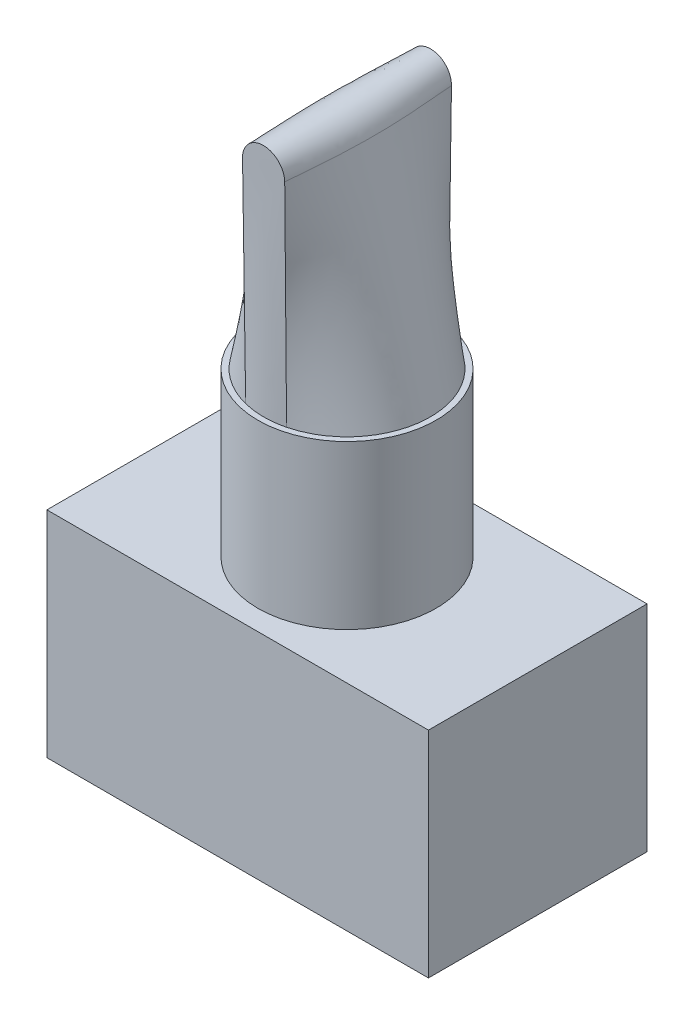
ISO-10303-21;
HEADER;
FILE_DESCRIPTION(('STEP AP214'),'2;1');
FILE_NAME('part.step','',(''),(''),'','','');
FILE_SCHEMA(('AUTOMOTIVE_DESIGN { 1 0 10303 214 1 1 1 1 }'));
ENDSEC;
DATA;
#1=APPLICATION_CONTEXT('core data for automotive mechanical design processes');
#2=APPLICATION_PROTOCOL_DEFINITION('international standard','automotive_design',2000,#1);
#3=PRODUCT_CONTEXT('',#1,'mechanical');
#4=PRODUCT('Part','Part','',(#3));
#5=PRODUCT_RELATED_PRODUCT_CATEGORY('part','',(#4));
#6=PRODUCT_DEFINITION_FORMATION('','',#4);
#7=PRODUCT_DEFINITION_CONTEXT('part definition',#1,'design');
#8=PRODUCT_DEFINITION('design','',#6,#7);
#9=PRODUCT_DEFINITION_SHAPE('','',#8);
#10=(LENGTH_UNIT() NAMED_UNIT(*) SI_UNIT(.MILLI.,.METRE.));
#11=(NAMED_UNIT(*) PLANE_ANGLE_UNIT() SI_UNIT($,.RADIAN.));
#12=(NAMED_UNIT(*) SI_UNIT($,.STERADIAN.) SOLID_ANGLE_UNIT());
#13=UNCERTAINTY_MEASURE_WITH_UNIT(LENGTH_MEASURE(1.E-05),#10,'distance_accuracy_value','');
#14=(GEOMETRIC_REPRESENTATION_CONTEXT(3) GLOBAL_UNCERTAINTY_ASSIGNED_CONTEXT((#13)) GLOBAL_UNIT_ASSIGNED_CONTEXT((#10,
#11,#12)) REPRESENTATION_CONTEXT('',''));
#15=CARTESIAN_POINT('',(0.,0.,0.));
#16=DIRECTION('',(0.,0.,1.));
#17=DIRECTION('',(1.,0.,0.));
#18=AXIS2_PLACEMENT_3D('',#15,#16,#17);
#19=CARTESIAN_POINT('',(-1.2558569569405,31.1108167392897,6.44652));
#20=CARTESIAN_POINT('',(-1.28835836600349,31.1105297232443,6.08838110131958));
#21=CARTESIAN_POINT('',(-1.3209773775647,31.1112541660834,5.73023999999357));
#22=CARTESIAN_POINT('',(-1.35392546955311,31.1135060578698,5.36680885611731));
#23=CARTESIAN_POINT('',(-1.35440512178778,31.1135394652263,5.3615177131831));
#24=CARTESIAN_POINT('',(-1.51672219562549,31.1247163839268,3.57081739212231));
#25=CARTESIAN_POINT('',(-1.70663240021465,31.1602442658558,1.78540885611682));
#26=CARTESIAN_POINT('',(-1.70663240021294,31.1602442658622,-1.78540885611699));
#27=CARTESIAN_POINT('',(-1.51672219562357,31.1247163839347,-3.57081739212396));
#28=CARTESIAN_POINT('',(-1.35440512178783,31.1135394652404,-5.36151771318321));
#29=CARTESIAN_POINT('',(-1.3539254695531,31.1135060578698,-5.36680885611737));
#30=CARTESIAN_POINT('',(-1.3209773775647,31.1112541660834,-5.7302399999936));
#31=CARTESIAN_POINT('',(-1.28835836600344,31.1105297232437,-6.08838110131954));
#32=CARTESIAN_POINT('',(-1.2558569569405,31.1108167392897,-6.44652));
#33=CARTESIAN_POINT('',(-1.32824466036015,31.9933494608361,6.44652));
#34=CARTESIAN_POINT('',(-1.3385898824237,32.0017464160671,6.09467268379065));
#35=CARTESIAN_POINT('',(-1.34863752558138,32.010173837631,5.73648510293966));
#36=CARTESIAN_POINT('',(-1.35824114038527,32.0189899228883,5.36681019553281));
#37=CARTESIAN_POINT('',(-1.35837823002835,32.0191162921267,5.36151905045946));
#38=CARTESIAN_POINT('',(-1.40123506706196,32.0584165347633,3.71117571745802));
#39=CARTESIAN_POINT('',(-1.45791870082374,32.0998293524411,1.78540885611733));
#40=CARTESIAN_POINT('',(-1.45791870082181,32.0998293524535,-1.78540885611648));
#41=CARTESIAN_POINT('',(-1.40123506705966,32.0584165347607,-3.71117571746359));
#42=CARTESIAN_POINT('',(-1.35837823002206,32.0191162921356,-5.36151905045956));
#43=CARTESIAN_POINT('',(-1.35824114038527,32.0189899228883,-5.36681019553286));
#44=CARTESIAN_POINT('',(-1.34863752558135,32.010173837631,-5.73648510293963));
#45=CARTESIAN_POINT('',(-1.33858988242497,32.0017464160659,-6.09467268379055));
#46=CARTESIAN_POINT('',(-1.32824466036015,31.9933494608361,-6.44652));
#47=CARTESIAN_POINT('',(-0.715687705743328,33.2506937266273,6.44652));
#48=CARTESIAN_POINT('',(-0.70358316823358,33.2184972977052,6.10328386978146));
#49=CARTESIAN_POINT('',(-0.692442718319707,33.1881848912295,5.74466914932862));
#50=CARTESIAN_POINT('',(-0.681837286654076,33.1589948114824,5.36681188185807));
#51=CARTESIAN_POINT('',(-0.681688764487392,33.1585862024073,5.36152073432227));
#52=CARTESIAN_POINT('',(-0.63972766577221,33.0429614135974,3.85917693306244));
#53=CARTESIAN_POINT('',(-0.616629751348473,32.948541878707,1.78540885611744));
#54=CARTESIAN_POINT('',(-0.616629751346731,32.948541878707,-1.78540885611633));
#55=CARTESIAN_POINT('',(-0.639727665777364,33.042961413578,-3.85917693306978));
#56=CARTESIAN_POINT('',(-0.681688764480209,33.1585862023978,-5.36152073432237));
#57=CARTESIAN_POINT('',(-0.681837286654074,33.1589948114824,-5.36681188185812));
#58=CARTESIAN_POINT('',(-0.692442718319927,33.1881848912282,-5.74466914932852));
#59=CARTESIAN_POINT('',(-0.703583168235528,33.2184972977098,-6.10328386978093));
#60=CARTESIAN_POINT('',(-0.715687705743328,33.2506937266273,-6.44652));
#61=CARTESIAN_POINT('',(0.715687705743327,33.2506937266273,6.44652));
#62=CARTESIAN_POINT('',(0.703583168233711,33.218497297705,6.10328386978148));
#63=CARTESIAN_POINT('',(0.692442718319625,33.1881848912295,5.74466914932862));
#64=CARTESIAN_POINT('',(0.681837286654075,33.1589948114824,5.36681188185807));
#65=CARTESIAN_POINT('',(0.681688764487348,33.1585862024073,5.36152073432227));
#66=CARTESIAN_POINT('',(0.639727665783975,33.0429614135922,3.85917693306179));
#67=CARTESIAN_POINT('',(0.616629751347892,32.948541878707,1.78540885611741));
#68=CARTESIAN_POINT('',(0.616629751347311,32.948541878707,-1.78540885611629));
#69=CARTESIAN_POINT('',(0.639727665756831,33.0429614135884,-3.85917693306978));
#70=CARTESIAN_POINT('',(0.681688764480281,33.1585862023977,-5.36152073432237));
#71=CARTESIAN_POINT('',(0.681837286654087,33.1589948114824,-5.36681188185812));
#72=CARTESIAN_POINT('',(0.692442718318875,33.1881848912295,-5.74466914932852));
#73=CARTESIAN_POINT('',(0.703583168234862,33.2184972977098,-6.10328386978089));
#74=CARTESIAN_POINT('',(0.715687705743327,33.2506937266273,-6.44652));
#75=CARTESIAN_POINT('',(1.32824466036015,31.9933494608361,6.44652));
#76=CARTESIAN_POINT('',(1.33858988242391,32.0017464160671,6.09467268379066));
#77=CARTESIAN_POINT('',(1.3486375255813,32.010173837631,5.73648510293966));
#78=CARTESIAN_POINT('',(1.35824114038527,32.0189899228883,5.36681019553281));
#79=CARTESIAN_POINT('',(1.35837823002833,32.0191162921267,5.36151905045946));
#80=CARTESIAN_POINT('',(1.40123506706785,32.0584165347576,3.71117571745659));
#81=CARTESIAN_POINT('',(1.45791870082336,32.0998293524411,1.78540885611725));
#82=CARTESIAN_POINT('',(1.4579187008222,32.0998293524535,-1.78540885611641));
#83=CARTESIAN_POINT('',(1.40123506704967,32.0584165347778,-3.71117571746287));
#84=CARTESIAN_POINT('',(1.35837823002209,32.0191162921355,-5.36151905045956));
#85=CARTESIAN_POINT('',(1.35824114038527,32.0189899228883,-5.36681019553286));
#86=CARTESIAN_POINT('',(1.34863752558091,32.010173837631,-5.73648510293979));
#87=CARTESIAN_POINT('',(1.33858988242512,32.0017464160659,-6.09467268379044));
#88=CARTESIAN_POINT('',(1.32824466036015,31.9933494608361,-6.44652));
#89=CARTESIAN_POINT('',(1.2558569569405,31.1108167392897,6.44652));
#90=CARTESIAN_POINT('',(1.28835836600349,31.1105297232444,6.08838110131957));
#91=CARTESIAN_POINT('',(1.3209773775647,31.1112541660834,5.73023999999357));
#92=CARTESIAN_POINT('',(1.35392546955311,31.1135060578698,5.36680885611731));
#93=CARTESIAN_POINT('',(1.35440512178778,31.1135394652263,5.36151771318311));
#94=CARTESIAN_POINT('',(1.51672219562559,31.1247163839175,3.57081739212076));
#95=CARTESIAN_POINT('',(1.70663240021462,31.1602442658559,1.78540885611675));
#96=CARTESIAN_POINT('',(1.70663240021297,31.1602442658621,-1.78540885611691));
#97=CARTESIAN_POINT('',(1.5167221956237,31.1247163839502,-3.57081739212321));
#98=CARTESIAN_POINT('',(1.35440512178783,31.1135394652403,-5.36151771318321));
#99=CARTESIAN_POINT('',(1.3539254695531,31.1135060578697,-5.36680885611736));
#100=CARTESIAN_POINT('',(1.32097737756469,31.111254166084,-5.73023999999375));
#101=CARTESIAN_POINT('',(1.2883583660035,31.1105297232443,-6.08838110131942));
#102=CARTESIAN_POINT('',(1.2558569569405,31.1108167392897,-6.44652));
#103=(BOUNDED_SURFACE() B_SPLINE_SURFACE(5,3,((#19,#20,#21,#22,#23,#24,#25,#26,#27,#28,#29,#30,
#31,#32),(#33,#34,#35,#36,#37,#38,#39,#40,#41,#42,#43,#44,#45,#46),(#47,#48,#49,#50,#51,#52,#53,
#54,#55,#56,#57,#58,#59,#60),(#61,#62,#63,#64,#65,#66,#67,#68,#69,#70,#71,#72,#73,#74),(#75,#76,
#77,#78,#79,#80,#81,#82,#83,#84,#85,#86,#87,#88),(#89,#90,#91,#92,#93,#94,#95,#96,#97,#98,#99,
#100,#101,#102)),.UNSPECIFIED.,.F.,.F.,.F.) B_SPLINE_SURFACE_WITH_KNOTS((6,6),(4,2,2,2,2,2,4),
(0.,1.),(-0.1,0.,0.00147739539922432,0.500000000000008,0.998522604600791,1.,1.1),
.UNSPECIFIED.) GEOMETRIC_REPRESENTATION_ITEM() RATIONAL_B_SPLINE_SURFACE(((1.,1.,1.,1.,1.,1.,1.,
1.,1.,1.,1.,1.,1.,1.),(0.567300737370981,0.577446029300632,0.587694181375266,0.598093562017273,
0.598245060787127,0.649452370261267,0.702357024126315,0.702357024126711,0.649452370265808,
0.598245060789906,0.59809356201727,0.587694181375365,0.57744602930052,0.567300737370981),
(0.350951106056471,0.366169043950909,0.381541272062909,0.39714034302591,0.397367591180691,
0.474178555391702,0.553535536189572,0.553535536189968,0.474178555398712,0.39736759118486,
0.397140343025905,0.381541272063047,0.36616904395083,0.350951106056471),(0.350951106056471,
0.366169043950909,0.381541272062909,0.39714034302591,0.397367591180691,0.474178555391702,
0.553535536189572,0.553535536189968,0.474178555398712,0.39736759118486,0.397140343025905,
0.381541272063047,0.36616904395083,0.350951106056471),(0.567300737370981,0.577446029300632,
0.587694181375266,0.598093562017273,0.598245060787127,0.649452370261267,0.702357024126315,
0.702357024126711,0.649452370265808,0.598245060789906,0.59809356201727,0.587694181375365,
0.57744602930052,0.567300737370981),(1.,1.,1.,1.,1.,1.,1.,1.,1.,1.,1.,1.,1.,1.))) REPRESENTATION_ITEM('') SURFACE());
#104=CARTESIAN_POINT('',(1.35488473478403,31.113572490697,-5.35622656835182));
#105=CARTESIAN_POINT('',(1.36841963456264,31.1145595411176,-5.20708633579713));
#106=CARTESIAN_POINT('',(1.38216158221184,31.1157579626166,-5.05796704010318));
#107=CARTESIAN_POINT('',(1.41425060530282,31.1188589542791,-4.71225036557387));
#108=CARTESIAN_POINT('',(1.43267019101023,31.1208642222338,-4.51566060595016));
#109=CARTESIAN_POINT('',(1.47402002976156,31.1255564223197,-4.07242655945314));
#110=CARTESIAN_POINT('',(1.49690500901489,31.1282869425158,-3.82577859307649));
#111=CARTESIAN_POINT('',(1.54577255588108,31.1345714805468,-3.27896067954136));
#112=CARTESIAN_POINT('',(1.57135436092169,31.1381758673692,-2.97875415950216));
#113=CARTESIAN_POINT('',(1.6138491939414,31.1445344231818,-2.42521655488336));
#114=CARTESIAN_POINT('',(1.63149288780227,31.1473331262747,-2.17194354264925));
#115=CARTESIAN_POINT('',(1.66072063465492,31.1520260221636,-1.68414549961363));
#116=CARTESIAN_POINT('',(1.67266059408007,31.1539724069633,-1.44964287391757));
#117=CARTESIAN_POINT('',(1.69052810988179,31.1570612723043,-1.00137778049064));
#118=CARTESIAN_POINT('',(1.69689741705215,31.1582600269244,-0.787633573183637));
#119=CARTESIAN_POINT('',(1.70472622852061,31.1598136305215,-0.382586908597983));
#120=CARTESIAN_POINT('',(1.70663244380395,31.1602441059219,-0.191293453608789));
#121=CARTESIAN_POINT('',(1.70663235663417,31.1602444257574,0.191247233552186));
#122=CARTESIAN_POINT('',(1.70472697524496,31.1598144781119,0.382494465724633));
#123=CARTESIAN_POINT('',(1.69690115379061,31.1582615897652,0.787479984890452));
#124=CARTESIAN_POINT('',(1.69053346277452,31.1570628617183,1.00120926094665));
#125=CARTESIAN_POINT('',(1.67266853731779,31.1539739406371,1.44947539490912));
#126=CARTESIAN_POINT('',(1.66072888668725,31.1520273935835,1.68399396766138));
#127=CARTESIAN_POINT('',(1.63149921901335,31.1473339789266,2.17185319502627));
#128=CARTESIAN_POINT('',(1.61385267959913,31.1445348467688,2.42517140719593));
#129=CARTESIAN_POINT('',(1.57135266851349,31.1381757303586,2.97877590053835));
#130=CARTESIAN_POINT('',(1.54576880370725,31.1345712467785,3.27900413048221));
#131=CARTESIAN_POINT('',(1.49689840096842,31.1282865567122,3.82585037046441));
#132=CARTESIAN_POINT('',(1.47401272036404,31.1255559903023,4.07250496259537));
#133=CARTESIAN_POINT('',(1.43266290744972,31.1208637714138,4.51573822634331));
#134=CARTESIAN_POINT('',(1.41424403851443,31.1188585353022,4.71232057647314));
#135=CARTESIAN_POINT('',(1.38215771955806,31.1157577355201,5.05800891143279));
#136=CARTESIAN_POINT('',(1.36841773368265,31.1145594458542,5.2071072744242));
#137=CARTESIAN_POINT('',(1.35488473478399,31.1135724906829,5.35622656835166));
#138=B_SPLINE_CURVE_WITH_KNOTS('',3,(#104,#105,#106,#107,#108,#109,#110,#111,#112,#113,#114,
#115,#116,#117,#118,#119,#120,#121,#122,#123,#124,#125,#126,#127,#128,#129,#130,#131,#132,#133,
#134,#135,#136,#137),.UNSPECIFIED.,.F.,.F.,(4,2,2,2,2,2,2,2,2,2,2,2,2,2,2,2,4),(0.,
0.449267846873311,1.04165011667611,1.78481771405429,2.68874135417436,3.45041168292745,
4.15480502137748,4.79628545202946,5.37015826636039,5.94389242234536,6.58532794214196,
7.28976899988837,8.05157517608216,8.95556423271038,9.69875181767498,10.2911117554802,
10.7403165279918),.UNSPECIFIED.);
#139=CARTESIAN_POINT('',(1.35488473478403,31.1135724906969,-5.35622656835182));
#140=VERTEX_POINT('',#139);
#141=CARTESIAN_POINT('',(1.35488473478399,31.1135724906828,5.35622656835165));
#142=VERTEX_POINT('',#141);
#143=EDGE_CURVE('E163',#140,#142,#138,.T.);
#144=CARTESIAN_POINT('',(-1.35488473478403,31.1135724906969,-5.35622656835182));
#145=CARTESIAN_POINT('',(-1.35493830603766,31.1314869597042,-5.35643557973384));
#146=CARTESIAN_POINT('',(-1.35464874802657,31.1494028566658,-5.35665200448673));
#147=CARTESIAN_POINT('',(-1.35337650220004,31.1851057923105,-5.35709642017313));
#148=CARTESIAN_POINT('',(-1.35239784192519,31.2028929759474,-5.35732433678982));
#149=CARTESIAN_POINT('',(-1.34974708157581,31.2383386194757,-5.35778993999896));
#150=CARTESIAN_POINT('',(-1.34807798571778,31.2559973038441,-5.35802758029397));
#151=CARTESIAN_POINT('',(-1.3440471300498,31.2911858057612,-5.35851077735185));
#152=CARTESIAN_POINT('',(-1.34168730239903,31.3087158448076,-5.35875631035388));
#153=CARTESIAN_POINT('',(-1.33627551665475,31.3436470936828,-5.35925345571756));
#154=CARTESIAN_POINT('',(-1.33322439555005,31.3610484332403,-5.35950506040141));
#155=CARTESIAN_POINT('',(-1.3264306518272,31.39572238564,-5.36001252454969));
#156=CARTESIAN_POINT('',(-1.32268776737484,31.4129949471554,-5.36026838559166));
#157=CARTESIAN_POINT('',(-1.31451109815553,31.4474115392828,-5.36078256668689));
#158=CARTESIAN_POINT('',(-1.3100759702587,31.4645552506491,-5.36104089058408));
#159=CARTESIAN_POINT('',(-1.30051544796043,31.4987144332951,-5.36155823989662));
#160=CARTESIAN_POINT('',(-1.29538766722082,31.5157292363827,-5.36181726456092));
#161=CARTESIAN_POINT('',(-1.28444228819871,31.5496309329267,-5.36233430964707));
#162=CARTESIAN_POINT('',(-1.278621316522,31.566516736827,-5.3625923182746));
#163=CARTESIAN_POINT('',(-1.26629054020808,31.6001609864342,-5.36310567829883));
#164=CARTESIAN_POINT('',(-1.25977645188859,31.6169178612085,-5.36336100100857));
#165=CARTESIAN_POINT('',(-1.24613478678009,31.6501178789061,-5.36386460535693));
#166=CARTESIAN_POINT('',(-1.23900922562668,31.6665618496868,-5.36411290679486));
#167=CARTESIAN_POINT('',(-1.22416764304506,31.6990615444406,-5.36460036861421));
#168=CARTESIAN_POINT('',(-1.2164554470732,31.7151190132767,-5.36483957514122));
#169=CARTESIAN_POINT('',(-1.20044181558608,31.7468460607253,-5.36530797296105));
#170=CARTESIAN_POINT('',(-1.19214321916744,31.7625170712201,-5.36553720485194));
#171=CARTESIAN_POINT('',(-1.17495748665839,31.7934715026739,-5.36598489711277));
#172=CARTESIAN_POINT('',(-1.16607219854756,31.8087559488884,-5.36620338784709));
#173=CARTESIAN_POINT('',(-1.1477139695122,31.8389376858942,-5.36662895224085));
#174=CARTESIAN_POINT('',(-1.13824189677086,31.8538355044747,-5.36683604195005));
#175=CARTESIAN_POINT('',(-1.11871096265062,31.8832445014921,-5.36723827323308));
#176=CARTESIAN_POINT('',(-1.10865202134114,31.8977556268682,-5.36743341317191));
#177=CARTESIAN_POINT('',(-1.08794820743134,31.9263918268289,-5.36781132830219));
#178=CARTESIAN_POINT('',(-1.07730235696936,31.9405161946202,-5.36799408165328));
#179=CARTESIAN_POINT('',(-1.05542559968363,31.9683795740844,-5.36834692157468));
#180=CARTESIAN_POINT('',(-1.04419288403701,31.9821171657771,-5.36851696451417));
#181=CARTESIAN_POINT('',(-1.02114306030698,32.0092076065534,-5.36884419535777));
#182=CARTESIAN_POINT('',(-1.00932339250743,32.0225582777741,-5.36900131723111));
#183=CARTESIAN_POINT('',(-0.985100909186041,32.0488760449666,-5.36930263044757));
#184=CARTESIAN_POINT('',(-0.972694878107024,32.0618401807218,-5.36944673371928));
#185=CARTESIAN_POINT('',(-0.947413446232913,32.0872684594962,-5.3697207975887));
#186=CARTESIAN_POINT('',(-0.934538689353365,32.09973324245,-5.36985077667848));
#187=CARTESIAN_POINT('',(-0.908391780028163,32.1240763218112,-5.37009628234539));
#188=CARTESIAN_POINT('',(-0.895122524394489,32.1359577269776,-5.37021189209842));
#189=CARTESIAN_POINT('',(-0.868188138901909,32.1591350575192,-5.37042943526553));
#190=CARTESIAN_POINT('',(-0.854525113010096,32.1704334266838,-5.37053142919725));
#191=CARTESIAN_POINT('',(-0.82680406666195,32.1924452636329,-5.37072256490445));
#192=CARTESIAN_POINT('',(-0.812747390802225,32.2031604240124,-5.3708117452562));
#193=CARTESIAN_POINT('',(-0.784240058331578,32.2240066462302,-5.37097811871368));
#194=CARTESIAN_POINT('',(-0.769790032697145,32.234138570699,-5.37105532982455));
#195=CARTESIAN_POINT('',(-0.740496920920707,32.2538191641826,-5.37119866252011));
#196=CARTESIAN_POINT('',(-0.725653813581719,32.2633678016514,-5.37126478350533));
#197=CARTESIAN_POINT('',(-0.695575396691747,32.2818827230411,-5.37138685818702));
#198=CARTESIAN_POINT('',(-0.680339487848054,32.2908480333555,-5.37144279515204));
#199=CARTESIAN_POINT('',(-0.649476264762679,32.3081972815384,-5.37154544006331));
#200=CARTESIAN_POINT('',(-0.633847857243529,32.3165792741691,-5.37159211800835));
#201=CARTESIAN_POINT('',(-0.60220025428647,32.3327627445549,-5.37167718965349));
#202=CARTESIAN_POINT('',(-0.586179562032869,32.3405612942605,-5.37171554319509));
#203=CARTESIAN_POINT('',(-0.553748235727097,32.355579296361,-5.37178491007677));
#204=CARTESIAN_POINT('',(-0.537335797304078,32.3627948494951,-5.37181587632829));
#205=CARTESIAN_POINT('',(-0.504199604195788,32.3766131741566,-5.37187126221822));
#206=CARTESIAN_POINT('',(-0.487475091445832,32.3832141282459,-5.37189566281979));
#207=CARTESIAN_POINT('',(-0.453881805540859,32.3957170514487,-5.37193862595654));
#208=CARTESIAN_POINT('',(-0.437014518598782,32.4016230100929,-5.37195722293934));
#209=CARTESIAN_POINT('',(-0.403136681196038,32.4127372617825,-5.3719896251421));
#210=CARTESIAN_POINT('',(-0.386127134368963,32.4179486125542,-5.37200345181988));
#211=CARTESIAN_POINT('',(-0.351965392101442,32.4276744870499,-5.37202725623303));
#212=CARTESIAN_POINT('',(-0.334813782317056,32.432191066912,-5.37203724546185));
#213=CARTESIAN_POINT('',(-0.300368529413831,32.4405284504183,-5.37205421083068));
#214=CARTESIAN_POINT('',(-0.283075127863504,32.4443502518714,-5.37206119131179));
#215=CARTESIAN_POINT('',(-0.248346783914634,32.4512991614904,-5.37207286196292));
#216=CARTESIAN_POINT('',(-0.230911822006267,32.4544261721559,-5.37207755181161));
#217=CARTESIAN_POINT('',(-0.195900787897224,32.4599865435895,-5.37208524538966));
#218=CARTESIAN_POINT('',(-0.178324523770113,32.4624186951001,-5.37208824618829));
#219=CARTESIAN_POINT('',(-0.143031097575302,32.4665906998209,-5.37209304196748));
#220=CARTESIAN_POINT('',(-0.125313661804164,32.4683282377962,-5.37209483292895));
#221=CARTESIAN_POINT('',(-0.0897384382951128,32.4711112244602,-5.37209755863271));
#222=CARTESIAN_POINT('',(-0.071880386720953,32.4721532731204,-5.37209848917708));
#223=CARTESIAN_POINT('',(-0.0360227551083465,32.4735497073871,-5.37209971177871));
#224=CARTESIAN_POINT('',(-0.0180229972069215,32.4738996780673,-5.37209999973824));
#225=CARTESIAN_POINT('',(1.86055345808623E-05,32.4739000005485,-5.37210000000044));
#226=CARTESIAN_POINT('',(6.23933640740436E-05,32.4738999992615,-5.37209999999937));
#227=CARTESIAN_POINT('',(0.000149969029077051,32.4738999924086,-5.37209999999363));
#228=CARTESIAN_POINT('',(0.000193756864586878,32.4738999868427,-5.37209999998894));
#229=CARTESIAN_POINT('',(0.000325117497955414,32.4738999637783,-5.37209999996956));
#230=CARTESIAN_POINT('',(0.000412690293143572,32.4738999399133,-5.3720999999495));
#231=CARTESIAN_POINT('',(0.000675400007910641,32.473899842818,-5.37209999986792));
#232=CARTESIAN_POINT('',(0.00085053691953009,32.4738997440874,-5.37209999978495));
#233=CARTESIAN_POINT('',(0.00137591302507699,32.4738993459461,-5.37209999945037));
#234=CARTESIAN_POINT('',(0.00172615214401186,32.4738989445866,-5.37209999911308));
#235=CARTESIAN_POINT('',(0.00277673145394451,32.47389733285,-5.3720999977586));
#236=CARTESIAN_POINT('',(0.00347707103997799,32.4738957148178,-5.37209999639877));
#237=CARTESIAN_POINT('',(0.00557754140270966,32.4738892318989,-5.37209999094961));
#238=CARTESIAN_POINT('',(0.00697766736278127,32.4738827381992,-5.37209998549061));
#239=CARTESIAN_POINT('',(0.0111758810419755,32.4738567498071,-5.37209996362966));
#240=CARTESIAN_POINT('',(0.0139739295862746,32.4738307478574,-5.3720999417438));
#241=CARTESIAN_POINT('',(0.0223596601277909,32.4737268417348,-5.37209985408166));
#242=CARTESIAN_POINT('',(0.0279470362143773,32.473623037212,-5.37209976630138));
#243=CARTESIAN_POINT('',(0.0401856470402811,32.4733195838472,-5.37209950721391));
#244=CARTESIAN_POINT('',(0.0468365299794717,32.4731054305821,-5.37209932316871));
#245=CARTESIAN_POINT('',(0.0579751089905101,32.4726649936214,-5.37209893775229));
#246=CARTESIAN_POINT('',(0.0624638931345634,32.4724652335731,-5.3720987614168));
#247=CARTESIAN_POINT('',(0.0802224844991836,32.4715859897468,-5.37209797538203));
#248=CARTESIAN_POINT('',(0.0934842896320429,32.4707327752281,-5.37209719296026));
#249=CARTESIAN_POINT('',(0.115618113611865,32.4689815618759,-5.37209548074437));
#250=CARTESIAN_POINT('',(0.124498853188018,32.4681906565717,-5.37209468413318));
#251=CARTESIAN_POINT('',(0.14215467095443,32.4664435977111,-5.37209284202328));
#252=CARTESIAN_POINT('',(0.150929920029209,32.4654891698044,-5.37209179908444));
#253=CARTESIAN_POINT('',(0.177246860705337,32.4623636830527,-5.37208821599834));
#254=CARTESIAN_POINT('',(0.194758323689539,32.4599321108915,-5.37208522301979));
#255=CARTESIAN_POINT('',(0.229723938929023,32.4543782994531,-5.37207755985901));
#256=CARTESIAN_POINT('',(0.24717776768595,32.4512540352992,-5.37207288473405));
#257=CARTESIAN_POINT('',(0.282028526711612,32.4443120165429,-5.37206124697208));
#258=CARTESIAN_POINT('',(0.299424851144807,32.440491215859,-5.37205427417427));
#259=CARTESIAN_POINT('',(0.334023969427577,32.4321704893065,-5.37203734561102));
#260=CARTESIAN_POINT('',(0.351227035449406,32.4276716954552,-5.37202739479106));
#261=CARTESIAN_POINT('',(0.385439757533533,32.4179966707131,-5.37200370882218));
#262=CARTESIAN_POINT('',(0.402449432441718,32.4128205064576,-5.37198997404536));
#263=CARTESIAN_POINT('',(0.436275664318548,32.4017922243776,-5.37195782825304));
#264=CARTESIAN_POINT('',(0.45309190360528,32.3959391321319,-5.37193941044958));
#265=CARTESIAN_POINT('',(0.486530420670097,32.3835557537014,-5.37189691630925));
#266=CARTESIAN_POINT('',(0.50315196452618,32.3770234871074,-5.37187282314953));
#267=CARTESIAN_POINT('',(0.536179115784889,32.3633022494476,-5.37181798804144));
#268=CARTESIAN_POINT('',(0.552583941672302,32.3561113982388,-5.37178722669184));
#269=CARTESIAN_POINT('',(0.585005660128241,32.3411403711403,-5.37171829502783));
#270=CARTESIAN_POINT('',(0.601024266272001,32.3333639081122,-5.3716801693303));
#271=CARTESIAN_POINT('',(0.632672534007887,32.317220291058,-5.3715955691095));
#272=CARTESIAN_POINT('',(0.64830359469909,32.3088558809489,-5.3715491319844));
#273=CARTESIAN_POINT('',(0.679177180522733,32.2915379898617,-5.37144697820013));
#274=CARTESIAN_POINT('',(0.69442068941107,32.2825862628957,-5.37139128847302));
#275=CARTESIAN_POINT('',(0.724519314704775,32.2640945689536,-5.3712697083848));
#276=CARTESIAN_POINT('',(0.739374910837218,32.2545553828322,-5.37120383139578));
#277=CARTESIAN_POINT('',(0.768698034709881,32.2348897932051,-5.37106097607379));
#278=CARTESIAN_POINT('',(0.783165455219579,32.2247632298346,-5.37098399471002));
#279=CARTESIAN_POINT('',(0.811712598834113,32.2039238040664,-5.37081805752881));
#280=CARTESIAN_POINT('',(0.825791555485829,32.1932098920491,-5.37072907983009));
#281=CARTESIAN_POINT('',(0.853562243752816,32.1711966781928,-5.37053831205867));
#282=CARTESIAN_POINT('',(0.867252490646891,32.1598955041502,-5.37043647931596));
#283=CARTESIAN_POINT('',(0.894246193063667,32.1367084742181,-5.37021920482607));
#284=CARTESIAN_POINT('',(0.907547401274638,32.1248200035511,-5.37010369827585));
#285=CARTESIAN_POINT('',(0.933763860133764,32.1004594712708,-5.36985832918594));
#286=CARTESIAN_POINT('',(0.946676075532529,32.0879841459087,-5.36972837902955));
#287=CARTESIAN_POINT('',(0.971983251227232,32.0625804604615,-5.3694548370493));
#288=CARTESIAN_POINT('',(0.984379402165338,32.0496532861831,-5.369311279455));
#289=CARTESIAN_POINT('',(1.00858569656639,32.0234040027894,-5.36901105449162));
#290=CARTESIAN_POINT('',(1.02039889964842,32.0100847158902,-5.36885447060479));
#291=CARTESIAN_POINT('',(1.04344016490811,31.9830523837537,-5.36852829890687));
#292=CARTESIAN_POINT('',(1.05467061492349,31.9693413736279,-5.36835877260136));
#293=CARTESIAN_POINT('',(1.0765470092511,31.9415262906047,-5.36800693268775));
#294=CARTESIAN_POINT('',(1.0871945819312,31.9274234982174,-5.36782465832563));
#295=CARTESIAN_POINT('',(1.10790606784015,31.8988256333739,-5.36744765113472));
#296=CARTESIAN_POINT('',(1.11797077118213,31.8843311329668,-5.36725293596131));
#297=CARTESIAN_POINT('',(1.13751744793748,31.854950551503,-5.36685148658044));
#298=CARTESIAN_POINT('',(1.14699930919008,31.8400643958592,-5.36664475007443));
#299=CARTESIAN_POINT('',(1.16538132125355,31.8099011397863,-5.36621980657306));
#300=CARTESIAN_POINT('',(1.17428041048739,31.7946233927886,-5.36600157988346));
#301=CARTESIAN_POINT('',(1.19149800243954,31.7636775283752,-5.36555431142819));
#302=CARTESIAN_POINT('',(1.19981446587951,31.7480082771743,-5.36532523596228));
#303=CARTESIAN_POINT('',(1.21586786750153,31.7162798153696,-5.36485702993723));
#304=CARTESIAN_POINT('',(1.22360177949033,31.7002190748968,-5.36461785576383));
#305=CARTESIAN_POINT('',(1.23849162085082,31.6677082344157,-5.36413031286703));
#306=CARTESIAN_POINT('',(1.24564355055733,31.6512563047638,-5.36388189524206));
#307=CARTESIAN_POINT('',(1.25934215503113,31.618028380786,-5.36337782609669));
#308=CARTESIAN_POINT('',(1.26588639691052,31.6012513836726,-5.363122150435));
#309=CARTESIAN_POINT('',(1.27827372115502,31.567562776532,-5.36260801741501));
#310=CARTESIAN_POINT('',(1.28412104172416,31.5506527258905,-5.36234958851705));
#311=CARTESIAN_POINT('',(1.29511619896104,31.5166987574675,-5.3618316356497));
#312=CARTESIAN_POINT('',(1.30026734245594,31.4996559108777,-5.36157212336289));
#313=CARTESIAN_POINT('',(1.30987147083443,31.4654367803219,-5.36105374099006));
#314=CARTESIAN_POINT('',(1.31432676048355,31.4482611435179,-5.36079487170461));
#315=CARTESIAN_POINT('',(1.32254071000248,31.4137768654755,-5.36027955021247));
#316=CARTESIAN_POINT('',(1.32630061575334,31.3964685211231,-5.36002309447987));
#317=CARTESIAN_POINT('',(1.33312536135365,31.3617191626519,-5.3595144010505));
#318=CARTESIAN_POINT('',(1.33619035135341,31.344278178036,-5.35926216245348));
#319=CARTESIAN_POINT('',(1.34162685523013,31.3092637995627,-5.35876371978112));
#320=CARTESIAN_POINT('',(1.34399740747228,31.2916902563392,-5.35851752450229));
#321=CARTESIAN_POINT('',(1.34804670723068,31.2564109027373,-5.35803298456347));
#322=CARTESIAN_POINT('',(1.34972338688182,31.2387048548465,-5.35779466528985));
#323=CARTESIAN_POINT('',(1.35238632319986,31.2031606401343,-5.35732769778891));
#324=CARTESIAN_POINT('',(1.35336943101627,31.1853222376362,-5.35709909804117));
#325=CARTESIAN_POINT('',(1.35464759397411,31.1495130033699,-5.35665332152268));
#326=CARTESIAN_POINT('',(1.35493847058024,31.131542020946,-5.3564362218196));
#327=CARTESIAN_POINT('',(1.35488473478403,31.1135724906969,-5.35622656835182));
#328=B_SPLINE_CURVE_WITH_KNOTS('',3,(#144,#145,#146,#147,#148,#149,#150,#151,#152,#153,#154,
#155,#156,#157,#158,#159,#160,#161,#162,#163,#164,#165,#166,#167,#168,#169,#170,#171,#172,#173,
#174,#175,#176,#177,#178,#179,#180,#181,#182,#183,#184,#185,#186,#187,#188,#189,#190,#191,#192,
#193,#194,#195,#196,#197,#198,#199,#200,#201,#202,#203,#204,#205,#206,#207,#208,#209,#210,#211,
#212,#213,#214,#215,#216,#217,#218,#219,#220,#221,#222,#223,#224,#225,#226,#227,#228,#229,#230,
#231,#232,#233,#234,#235,#236,#237,#238,#239,#240,#241,#242,#243,#244,#245,#246,#247,#248,#249,
#250,#251,#252,#253,#254,#255,#256,#257,#258,#259,#260,#261,#262,#263,#264,#265,#266,#267,#268,
#269,#270,#271,#272,#273,#274,#275,#276,#277,#278,#279,#280,#281,#282,#283,#284,#285,#286,#287,
#288,#289,#290,#291,#292,#293,#294,#295,#296,#297,#298,#299,#300,#301,#302,#303,#304,#305,#306,
#307,#308,#309,#310,#311,#312,#313,#314,#315,#316,#317,#318,#319,#320,#321,#322,#323,#324,#325,
#326,#327),.UNSPECIFIED.,.F.,.F.,(4,2,2,2,2,2,2,2,2,2,2,2,2,2,2,2,2,2,2,2,2,2,2,2,2,2,2,2,2,2,2,
2,2,2,2,2,2,2,2,2,2,2,2,2,2,2,2,2,2,2,2,2,2,2,2,2,2,2,2,2,2,2,2,2,2,2,2,2,2,2,2,2,2,2,2,2,2,2,2,
2,2,2,2,2,2,2,2,2,2,2,2,4),(0.,0.0537447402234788,0.107177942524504,0.160381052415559,
0.2134367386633,0.266428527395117,0.319440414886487,0.372556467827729,0.425860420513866,
0.479435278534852,0.533362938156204,0.587119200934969,0.640550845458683,0.693739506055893,
0.746767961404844,0.799719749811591,0.85267876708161,0.905728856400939,0.958953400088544,
1.01243492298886,1.06625471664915,1.12000317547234,1.17342438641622,1.22659963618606,
1.2796112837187,1.33254239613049,1.38547636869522,1.43849653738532,1.4916857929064,
1.54512620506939,1.59889866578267,1.6528253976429,1.7064256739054,1.75978160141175,
1.81297645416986,1.8660942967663,1.91921958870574,1.9724367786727,2.02582989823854,
2.07948216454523,2.13347560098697,2.13360696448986,2.13373832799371,2.13400104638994,
2.13452645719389,2.13557717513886,2.13767819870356,2.14187861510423,2.15027307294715,
2.16703766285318,2.18699983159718,2.20047939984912,2.24034016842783,2.26708630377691,
2.29356585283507,2.34658937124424,2.39976998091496,2.45318899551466,2.50651978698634,
2.55984533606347,2.61324862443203,2.66681224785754,2.72053385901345,2.77393966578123,
2.82711094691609,2.88013008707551,2.93308021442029,2.98604482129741,3.03910737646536,
3.09235093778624,3.14585777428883,3.19970900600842,3.25342819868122,3.30682632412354,
3.3599848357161,3.41298634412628,3.46591423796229,3.51885228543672,3.57188422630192,
3.62509336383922,3.67856216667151,3.73237188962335,3.78638850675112,3.84005776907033,
3.89346240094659,3.94668621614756,3.99981372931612,4.05292975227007,4.10611898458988,
4.15946560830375,4.21305289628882,4.26696284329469),.UNSPECIFIED.);
#329=CARTESIAN_POINT('',(-1.35488473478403,31.1135724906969,-5.35622656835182));
#330=VERTEX_POINT('',#329);
#331=EDGE_CURVE('E78',#330,#140,#328,.T.);
#332=CARTESIAN_POINT('',(-1.35488473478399,31.1135724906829,5.35622656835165));
#333=CARTESIAN_POINT('',(-1.36841963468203,31.1145595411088,5.20708633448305));
#334=CARTESIAN_POINT('',(-1.38216158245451,31.1157579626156,5.05796703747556));
#335=CARTESIAN_POINT('',(-1.41425060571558,31.1188589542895,4.71225036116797));
#336=CARTESIAN_POINT('',(-1.4326701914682,31.1208642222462,4.51566060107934));
#337=CARTESIAN_POINT('',(-1.47402003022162,31.1255564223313,4.07242655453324));
#338=CARTESIAN_POINT('',(-1.49690500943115,31.1282869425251,3.82577858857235));
#339=CARTESIAN_POINT('',(-1.54577255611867,31.1345714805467,3.27896067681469));
#340=CARTESIAN_POINT('',(-1.57135436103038,31.1381758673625,2.97875415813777));
#341=CARTESIAN_POINT('',(-1.61384919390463,31.1445344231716,2.42521655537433));
#342=CARTESIAN_POINT('',(-1.63149288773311,31.147333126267,2.17194354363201));
#343=CARTESIAN_POINT('',(-1.66072063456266,31.1520260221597,1.68414550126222));
#344=CARTESIAN_POINT('',(-1.67266059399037,31.1539724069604,1.44964287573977));
#345=CARTESIAN_POINT('',(-1.69052810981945,31.1570612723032,1.00137778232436));
#346=CARTESIAN_POINT('',(-1.69689741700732,31.1582600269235,0.787633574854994));
#347=CARTESIAN_POINT('',(-1.70472622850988,31.1598136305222,0.382586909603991));
#348=CARTESIAN_POINT('',(-1.70663244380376,31.1602441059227,0.191293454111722));
#349=CARTESIAN_POINT('',(-1.70663235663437,31.1602444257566,-0.191247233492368));
#350=CARTESIAN_POINT('',(-1.70472697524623,31.1598144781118,-0.382494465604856));
#351=CARTESIAN_POINT('',(-1.69690115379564,31.1582615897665,-0.787479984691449));
#352=CARTESIAN_POINT('',(-1.69053346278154,31.15706286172,-1.00120926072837));
#353=CARTESIAN_POINT('',(-1.67266853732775,31.1539739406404,-1.44947539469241));
#354=CARTESIAN_POINT('',(-1.66072888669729,31.1520273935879,-1.68399396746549));
#355=CARTESIAN_POINT('',(-1.63149921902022,31.1473339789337,-2.17185319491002));
#356=CARTESIAN_POINT('',(-1.61385267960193,31.1445348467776,-2.42517140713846));
#357=CARTESIAN_POINT('',(-1.57135266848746,31.1381757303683,-2.97877590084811));
#358=CARTESIAN_POINT('',(-1.54576880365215,31.1345712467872,-3.27900413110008));
#359=CARTESIAN_POINT('',(-1.49689840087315,31.1282865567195,-3.82585037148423));
#360=CARTESIAN_POINT('',(-1.47401272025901,31.1255559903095,-4.07250496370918));
#361=CARTESIAN_POINT('',(-1.43266290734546,31.1208637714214,-4.51573822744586));
#362=CARTESIAN_POINT('',(-1.41424403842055,31.1188585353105,-4.71232057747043));
#363=CARTESIAN_POINT('',(-1.38215771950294,31.1157577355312,-5.05800891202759));
#364=CARTESIAN_POINT('',(-1.36841773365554,31.1145594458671,-5.20710727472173));
#365=CARTESIAN_POINT('',(-1.35488473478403,31.113572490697,-5.35622656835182));
#366=B_SPLINE_CURVE_WITH_KNOTS('',3,(#332,#333,#334,#335,#336,#337,#338,#339,#340,#341,#342,
#343,#344,#345,#346,#347,#348,#349,#350,#351,#352,#353,#354,#355,#356,#357,#358,#359,#360,#361,
#362,#363,#364,#365),.UNSPECIFIED.,.F.,.F.,(4,2,2,2,2,2,2,2,2,2,2,2,2,2,2,2,4),(0.,
0.449267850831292,1.04165012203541,1.78481771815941,2.68874135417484,3.45041168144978,
4.15480501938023,4.7962854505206,5.37015826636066,5.94389242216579,6.5853279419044,
7.28976899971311,8.05157517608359,8.95556423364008,9.69875181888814,10.291111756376,
10.7403165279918),.UNSPECIFIED.);
#367=CARTESIAN_POINT('',(-1.35488473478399,31.1135724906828,5.35622656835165));
#368=VERTEX_POINT('',#367);
#369=EDGE_CURVE('E319',#368,#330,#366,.T.);
#370=CARTESIAN_POINT('',(1.35488473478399,31.1135724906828,5.35622656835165));
#371=CARTESIAN_POINT('',(1.35493830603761,31.13148695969,5.35643557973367));
#372=CARTESIAN_POINT('',(1.35464874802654,31.1494028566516,5.35665200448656));
#373=CARTESIAN_POINT('',(1.35337650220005,31.1851057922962,5.35709642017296));
#374=CARTESIAN_POINT('',(1.35239784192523,31.202892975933,5.35732433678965));
#375=CARTESIAN_POINT('',(1.34974708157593,31.2383386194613,5.35778993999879));
#376=CARTESIAN_POINT('',(1.34807798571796,31.2559973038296,5.35802758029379));
#377=CARTESIAN_POINT('',(1.34404713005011,31.2911858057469,5.35851077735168));
#378=CARTESIAN_POINT('',(1.34168730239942,31.3087158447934,5.35875631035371));
#379=CARTESIAN_POINT('',(1.3362755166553,31.3436470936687,5.35925345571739));
#380=CARTESIAN_POINT('',(1.3332243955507,31.3610484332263,5.35950506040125));
#381=CARTESIAN_POINT('',(1.32643065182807,31.3957223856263,5.36001252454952));
#382=CARTESIAN_POINT('',(1.32268776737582,31.4129949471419,5.3602683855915));
#383=CARTESIAN_POINT('',(1.31451109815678,31.4474115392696,5.36078256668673));
#384=CARTESIAN_POINT('',(1.31007597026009,31.4645552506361,5.36104089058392));
#385=CARTESIAN_POINT('',(1.30051544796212,31.4987144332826,5.36155823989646));
#386=CARTESIAN_POINT('',(1.29538766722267,31.5157292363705,5.36181726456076));
#387=CARTESIAN_POINT('',(1.2844422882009,31.549630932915,5.36233430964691));
#388=CARTESIAN_POINT('',(1.27862131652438,31.5665167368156,5.36259231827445));
#389=CARTESIAN_POINT('',(1.26629054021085,31.6001609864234,5.36310567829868));
#390=CARTESIAN_POINT('',(1.25977645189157,31.6169178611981,5.36336100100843));
#391=CARTESIAN_POINT('',(1.24613478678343,31.6501178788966,5.36386460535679));
#392=CARTESIAN_POINT('',(1.23900922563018,31.6665618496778,5.36411290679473));
#393=CARTESIAN_POINT('',(1.22416764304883,31.6990615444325,5.36460036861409));
#394=CARTESIAN_POINT('',(1.2164554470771,31.7151190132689,5.3648395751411));
#395=CARTESIAN_POINT('',(1.2004418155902,31.7468460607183,5.36530797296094));
#396=CARTESIAN_POINT('',(1.19214321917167,31.7625170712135,5.36553720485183));
#397=CARTESIAN_POINT('',(1.1749574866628,31.7934715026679,5.36598489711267));
#398=CARTESIAN_POINT('',(1.16607219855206,31.8087559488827,5.366203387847));
#399=CARTESIAN_POINT('',(1.14771396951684,31.8389376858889,5.36662895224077));
#400=CARTESIAN_POINT('',(1.13824189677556,31.8538355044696,5.36683604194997));
#401=CARTESIAN_POINT('',(1.11871096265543,31.8832445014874,5.367238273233));
#402=CARTESIAN_POINT('',(1.10865202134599,31.8977556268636,5.36743341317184));
#403=CARTESIAN_POINT('',(1.08794820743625,31.9263918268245,5.36781132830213));
#404=CARTESIAN_POINT('',(1.07730235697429,31.9405161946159,5.36799408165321));
#405=CARTESIAN_POINT('',(1.05542559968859,31.9683795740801,5.36834692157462));
#406=CARTESIAN_POINT('',(1.04419288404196,31.9821171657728,5.36851696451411));
#407=CARTESIAN_POINT('',(1.02114306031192,32.009207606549,5.36884419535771));
#408=CARTESIAN_POINT('',(1.00932339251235,32.0225582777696,5.36900131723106));
#409=CARTESIAN_POINT('',(0.985100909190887,32.0488760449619,5.36930263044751));
#410=CARTESIAN_POINT('',(0.972694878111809,32.0618401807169,5.36944673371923));
#411=CARTESIAN_POINT('',(0.947413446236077,32.0872684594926,5.36972079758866));
#412=CARTESIAN_POINT('',(0.934538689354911,32.0997332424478,5.36985077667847));
#413=CARTESIAN_POINT('',(0.908391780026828,32.1240763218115,5.3700962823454));
#414=CARTESIAN_POINT('',(0.895122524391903,32.135957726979,5.37021189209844));
#415=CARTESIAN_POINT('',(0.868188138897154,32.1591350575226,5.37042943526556));
#416=CARTESIAN_POINT('',(0.854525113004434,32.170433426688,5.37053142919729));
#417=CARTESIAN_POINT('',(0.826804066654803,32.1924452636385,5.3707225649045));
#418=CARTESIAN_POINT('',(0.812747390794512,32.2031604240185,5.37081174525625));
#419=CARTESIAN_POINT('',(0.784240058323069,32.2240066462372,5.37097811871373));
#420=CARTESIAN_POINT('',(0.769790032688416,32.2341385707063,5.37105532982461));
#421=CARTESIAN_POINT('',(0.740496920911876,32.2538191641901,5.37119866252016));
#422=CARTESIAN_POINT('',(0.725653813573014,32.2633678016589,5.37126478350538));
#423=CARTESIAN_POINT('',(0.695575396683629,32.2818827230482,5.37138685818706));
#424=CARTESIAN_POINT('',(0.680339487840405,32.2908480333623,5.37144279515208));
#425=CARTESIAN_POINT('',(0.649476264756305,32.3081972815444,5.37154544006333));
#426=CARTESIAN_POINT('',(0.63384785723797,32.3165792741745,5.37159211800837));
#427=CARTESIAN_POINT('',(0.602200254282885,32.3327627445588,5.37167718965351));
#428=CARTESIAN_POINT('',(0.58617956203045,32.3405612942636,5.3717155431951));
#429=CARTESIAN_POINT('',(0.553748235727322,32.355579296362,5.37178491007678));
#430=CARTESIAN_POINT('',(0.537335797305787,32.3627948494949,5.37181587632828));
#431=CARTESIAN_POINT('',(0.5041996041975,32.3766131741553,5.37187126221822));
#432=CARTESIAN_POINT('',(0.487475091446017,32.3832141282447,5.37189566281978));
#433=CARTESIAN_POINT('',(0.453881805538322,32.3957170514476,5.37193862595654));
#434=CARTESIAN_POINT('',(0.437014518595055,32.4016230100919,5.37195722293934));
#435=CARTESIAN_POINT('',(0.403136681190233,32.4127372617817,5.3719896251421));
#436=CARTESIAN_POINT('',(0.386127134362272,32.4179486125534,5.37200345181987));
#437=CARTESIAN_POINT('',(0.351965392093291,32.4276744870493,5.37202725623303));
#438=CARTESIAN_POINT('',(0.334813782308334,32.4321910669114,5.37203724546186));
#439=CARTESIAN_POINT('',(0.300368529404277,32.4405284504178,5.37205421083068));
#440=CARTESIAN_POINT('',(0.283075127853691,32.444350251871,5.37206119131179));
#441=CARTESIAN_POINT('',(0.248346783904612,32.45129916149,5.37207286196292));
#442=CARTESIAN_POINT('',(0.230911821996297,32.4544261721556,5.37207755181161));
#443=CARTESIAN_POINT('',(0.19590078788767,32.4599865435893,5.37208524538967));
#444=CARTESIAN_POINT('',(0.178324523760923,32.4624186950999,5.37208824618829));
#445=CARTESIAN_POINT('',(0.143031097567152,32.4665906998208,5.37209304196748));
#446=CARTESIAN_POINT('',(0.125313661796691,32.4683282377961,5.37209483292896));
#447=CARTESIAN_POINT('',(0.0897384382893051,32.4711112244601,5.37209755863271));
#448=CARTESIAN_POINT('',(0.0718803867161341,32.4721532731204,5.37209848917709));
#449=CARTESIAN_POINT('',(0.0360227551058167,32.4735497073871,5.37209971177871));
#450=CARTESIAN_POINT('',(0.0180229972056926,32.4738996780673,5.37209999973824));
#451=CARTESIAN_POINT('',(-1.86055345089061E-05,32.4739000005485,5.37210000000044));
#452=CARTESIAN_POINT('',(-6.23933640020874E-05,32.4738999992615,5.37209999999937));
#453=CARTESIAN_POINT('',(-0.000149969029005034,32.4738999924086,5.37209999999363));
#454=CARTESIAN_POINT('',(-0.0001937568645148,32.4738999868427,5.37209999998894));
#455=CARTESIAN_POINT('',(-0.000325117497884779,32.4738999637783,5.37209999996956));
#456=CARTESIAN_POINT('',(-0.000412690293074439,32.4738999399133,5.3720999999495));
#457=CARTESIAN_POINT('',(-0.000675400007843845,32.473899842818,5.37209999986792));
#458=CARTESIAN_POINT('',(-0.000850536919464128,32.4738997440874,5.37209999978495));
#459=CARTESIAN_POINT('',(-0.00137591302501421,32.4738993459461,5.37209999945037));
#460=CARTESIAN_POINT('',(-0.00172615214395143,32.4738989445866,5.37209999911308));
#461=CARTESIAN_POINT('',(-0.00277673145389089,32.4738973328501,5.3720999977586));
#462=CARTESIAN_POINT('',(-0.00347707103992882,32.4738957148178,5.37209999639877));
#463=CARTESIAN_POINT('',(-0.00557754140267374,32.4738892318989,5.37209999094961));
#464=CARTESIAN_POINT('',(-0.00697766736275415,32.4738827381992,5.37209998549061));
#465=CARTESIAN_POINT('',(-0.0111758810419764,32.4738567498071,5.37209996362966));
#466=CARTESIAN_POINT('',(-0.013973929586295,32.4738307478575,5.3720999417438));
#467=CARTESIAN_POINT('',(-0.0223596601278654,32.4737268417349,5.37209985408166));
#468=CARTESIAN_POINT('',(-0.0279470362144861,32.473623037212,5.37209976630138));
#469=CARTESIAN_POINT('',(-0.0401856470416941,32.4733195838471,5.37209950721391));
#470=CARTESIAN_POINT('',(-0.0468365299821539,32.4731054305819,5.37209932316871));
#471=CARTESIAN_POINT('',(-0.0579751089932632,32.4726649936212,5.37209893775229));
#472=CARTESIAN_POINT('',(-0.0624638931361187,32.472465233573,5.3720987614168));
#473=CARTESIAN_POINT('',(-0.0802224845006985,32.4715859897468,5.37209797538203));
#474=CARTESIAN_POINT('',(-0.0934842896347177,32.4707327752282,5.37209719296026));
#475=CARTESIAN_POINT('',(-0.115618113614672,32.4689815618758,5.37209548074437));
#476=CARTESIAN_POINT('',(-0.124498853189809,32.4681906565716,5.37209468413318));
#477=CARTESIAN_POINT('',(-0.142154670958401,32.4664435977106,5.37209284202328));
#478=CARTESIAN_POINT('',(-0.150929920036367,32.4654891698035,5.37209179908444));
#479=CARTESIAN_POINT('',(-0.177246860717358,32.462363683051,5.37208821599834));
#480=CARTESIAN_POINT('',(-0.194758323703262,32.4599321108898,5.37208522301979));
#481=CARTESIAN_POINT('',(-0.229723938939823,32.4543782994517,5.37207755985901));
#482=CARTESIAN_POINT('',(-0.247177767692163,32.4512540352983,5.37207288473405));
#483=CARTESIAN_POINT('',(-0.282028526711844,32.4443120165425,5.37206124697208));
#484=CARTESIAN_POINT('',(-0.299424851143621,32.4404912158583,5.37205427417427));
#485=CARTESIAN_POINT('',(-0.334023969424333,32.4321704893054,5.37203734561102));
#486=CARTESIAN_POINT('',(-0.351227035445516,32.427671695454,5.37202739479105));
#487=CARTESIAN_POINT('',(-0.385439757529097,32.4179966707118,5.37200370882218));
#488=CARTESIAN_POINT('',(-0.402449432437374,32.4128205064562,5.37198997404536));
#489=CARTESIAN_POINT('',(-0.436275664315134,32.401792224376,5.37195782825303));
#490=CARTESIAN_POINT('',(-0.453091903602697,32.3959391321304,5.37193941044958));
#491=CARTESIAN_POINT('',(-0.486530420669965,32.3835557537,5.37189691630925));
#492=CARTESIAN_POINT('',(-0.503151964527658,32.3770234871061,5.37187282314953));
#493=CARTESIAN_POINT('',(-0.53617911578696,32.3633022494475,5.37181798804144));
#494=CARTESIAN_POINT('',(-0.552583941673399,32.3561113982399,5.37178722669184));
#495=CARTESIAN_POINT('',(-0.585005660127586,32.3411403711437,5.37171829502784));
#496=CARTESIAN_POINT('',(-0.601024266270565,32.3333639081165,5.37168016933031));
#497=CARTESIAN_POINT('',(-0.63267253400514,32.3172202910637,5.37159556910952));
#498=CARTESIAN_POINT('',(-0.648303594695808,32.3088558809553,5.37154913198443));
#499=CARTESIAN_POINT('',(-0.679177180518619,32.291537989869,5.37144697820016));
#500=CARTESIAN_POINT('',(-0.694420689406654,32.2825862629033,5.37139128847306));
#501=CARTESIAN_POINT('',(-0.724519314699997,32.2640945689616,5.37126970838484));
#502=CARTESIAN_POINT('',(-0.739374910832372,32.2545553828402,5.37120383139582));
#503=CARTESIAN_POINT('',(-0.768698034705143,32.2348897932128,5.37106097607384));
#504=CARTESIAN_POINT('',(-0.783165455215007,32.224763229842,5.37098399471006));
#505=CARTESIAN_POINT('',(-0.811712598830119,32.203923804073,5.37081805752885));
#506=CARTESIAN_POINT('',(-0.825791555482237,32.1932098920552,5.37072907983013));
#507=CARTESIAN_POINT('',(-0.853562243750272,32.1711966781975,5.3705383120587));
#508=CARTESIAN_POINT('',(-0.867252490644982,32.159895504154,5.37043647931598));
#509=CARTESIAN_POINT('',(-0.894246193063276,32.1367084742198,5.37021920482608));
#510=CARTESIAN_POINT('',(-0.907547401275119,32.1248200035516,5.37010369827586));
#511=CARTESIAN_POINT('',(-0.933763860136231,32.1004594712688,5.36985832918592));
#512=CARTESIAN_POINT('',(-0.9466760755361,32.0879841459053,5.36972837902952));
#513=CARTESIAN_POINT('',(-0.971983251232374,32.0625804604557,5.36945483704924));
#514=CARTESIAN_POINT('',(-0.98437940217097,32.0496532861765,5.36931127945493));
#515=CARTESIAN_POINT('',(-1.00858569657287,32.0234040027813,5.36901105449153));
#516=CARTESIAN_POINT('',(-1.02039889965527,32.0100847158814,5.36885447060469));
#517=CARTESIAN_POINT('',(-1.04344016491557,31.9830523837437,5.36852829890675));
#518=CARTESIAN_POINT('',(-1.05467061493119,31.9693413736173,5.36835877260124));
#519=CARTESIAN_POINT('',(-1.07654700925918,31.9415262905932,5.36800693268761));
#520=CARTESIAN_POINT('',(-1.08719458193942,31.9274234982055,5.36782465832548));
#521=CARTESIAN_POINT('',(-1.1079060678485,31.8988256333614,5.36744765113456));
#522=CARTESIAN_POINT('',(-1.11797077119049,31.8843311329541,5.36725293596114));
#523=CARTESIAN_POINT('',(-1.13751744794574,31.8549505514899,5.36685148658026));
#524=CARTESIAN_POINT('',(-1.14699930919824,31.840064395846,5.36664475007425));
#525=CARTESIAN_POINT('',(-1.16538132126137,31.8099011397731,5.36621980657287));
#526=CARTESIAN_POINT('',(-1.17428041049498,31.7946233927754,5.36600157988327));
#527=CARTESIAN_POINT('',(-1.19149800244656,31.7636775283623,5.365554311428));
#528=CARTESIAN_POINT('',(-1.19981446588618,31.7480082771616,5.36532523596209));
#529=CARTESIAN_POINT('',(-1.21586786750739,31.7162798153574,5.36485702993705));
#530=CARTESIAN_POINT('',(-1.22360177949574,31.700219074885,5.36461785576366));
#531=CARTESIAN_POINT('',(-1.23849162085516,31.6677082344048,5.36413031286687));
#532=CARTESIAN_POINT('',(-1.24564355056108,31.6512563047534,5.36388189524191));
#533=CARTESIAN_POINT('',(-1.2593421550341,31.6180283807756,5.36337782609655));
#534=CARTESIAN_POINT('',(-1.26588639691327,31.6012513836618,5.36312215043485));
#535=CARTESIAN_POINT('',(-1.27827372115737,31.5675627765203,5.36260801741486));
#536=CARTESIAN_POINT('',(-1.28412104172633,31.5506527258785,5.36234958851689));
#537=CARTESIAN_POINT('',(-1.29511619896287,31.5166987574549,5.36183163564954));
#538=CARTESIAN_POINT('',(-1.30026734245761,31.4996559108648,5.36157212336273));
#539=CARTESIAN_POINT('',(-1.3098714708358,31.4654367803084,5.36105374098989));
#540=CARTESIAN_POINT('',(-1.31432676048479,31.4482611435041,5.36079487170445));
#541=CARTESIAN_POINT('',(-1.32254071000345,31.4137768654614,5.3602795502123));
#542=CARTESIAN_POINT('',(-1.3263006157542,31.3964685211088,5.36002309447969));
#543=CARTESIAN_POINT('',(-1.33312536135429,31.3617191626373,5.35951440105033));
#544=CARTESIAN_POINT('',(-1.33619035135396,31.3442781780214,5.3592621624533));
#545=CARTESIAN_POINT('',(-1.34162685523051,31.3092637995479,5.35876371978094));
#546=CARTESIAN_POINT('',(-1.34399740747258,31.2916902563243,5.35851752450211));
#547=CARTESIAN_POINT('',(-1.34804670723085,31.2564109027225,5.3580329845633));
#548=CARTESIAN_POINT('',(-1.34972338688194,31.2387048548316,5.35779466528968));
#549=CARTESIAN_POINT('',(-1.3523863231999,31.2031606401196,5.35732769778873));
#550=CARTESIAN_POINT('',(-1.35336943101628,31.1853222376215,5.357099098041));
#551=CARTESIAN_POINT('',(-1.35464759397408,31.1495130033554,5.35665332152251));
#552=CARTESIAN_POINT('',(-1.3549384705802,31.1315420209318,5.35643622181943));
#553=CARTESIAN_POINT('',(-1.35488473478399,31.1135724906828,5.35622656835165));
#554=B_SPLINE_CURVE_WITH_KNOTS('',3,(#370,#371,#372,#373,#374,#375,#376,#377,#378,#379,#380,
#381,#382,#383,#384,#385,#386,#387,#388,#389,#390,#391,#392,#393,#394,#395,#396,#397,#398,#399,
#400,#401,#402,#403,#404,#405,#406,#407,#408,#409,#410,#411,#412,#413,#414,#415,#416,#417,#418,
#419,#420,#421,#422,#423,#424,#425,#426,#427,#428,#429,#430,#431,#432,#433,#434,#435,#436,#437,
#438,#439,#440,#441,#442,#443,#444,#445,#446,#447,#448,#449,#450,#451,#452,#453,#454,#455,#456,
#457,#458,#459,#460,#461,#462,#463,#464,#465,#466,#467,#468,#469,#470,#471,#472,#473,#474,#475,
#476,#477,#478,#479,#480,#481,#482,#483,#484,#485,#486,#487,#488,#489,#490,#491,#492,#493,#494,
#495,#496,#497,#498,#499,#500,#501,#502,#503,#504,#505,#506,#507,#508,#509,#510,#511,#512,#513,
#514,#515,#516,#517,#518,#519,#520,#521,#522,#523,#524,#525,#526,#527,#528,#529,#530,#531,#532,
#533,#534,#535,#536,#537,#538,#539,#540,#541,#542,#543,#544,#545,#546,#547,#548,#549,#550,#551,
#552,#553),.UNSPECIFIED.,.F.,.F.,(4,2,2,2,2,2,2,2,2,2,2,2,2,2,2,2,2,2,2,2,2,2,2,2,2,2,2,2,2,2,2,
2,2,2,2,2,2,2,2,2,2,2,2,2,2,2,2,2,2,2,2,2,2,2,2,2,2,2,2,2,2,2,2,2,2,2,2,2,2,2,2,2,2,2,2,2,2,2,2,
2,2,2,2,2,2,2,2,2,2,2,2,4),(0.,0.0537447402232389,0.107177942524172,0.160381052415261,
0.213436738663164,0.266428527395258,0.319440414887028,0.372556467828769,0.42586042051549,
0.47943527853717,0.533362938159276,0.587119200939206,0.640550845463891,0.693739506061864,
0.746767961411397,0.799719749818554,0.852678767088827,0.905728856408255,0.958953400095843,
1.012434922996,1.06625471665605,1.12000317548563,1.17342438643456,1.22659963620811,
1.27961128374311,1.33254239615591,1.3854763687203,1.43849653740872,1.49168579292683,
1.54512620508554,1.59889866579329,1.65282539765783,1.7064256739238,1.75978160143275,
1.81297645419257,1.86609429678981,1.91921958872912,1.97243677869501,2.02582989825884,
2.07948216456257,2.13347560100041,2.1336069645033,2.13373832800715,2.13400104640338,
2.13452645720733,2.13557717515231,2.13767819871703,2.14187861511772,2.1502730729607,
2.16703766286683,2.18699983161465,2.20047939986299,2.24034016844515,2.26708630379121,
2.29356585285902,2.34658937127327,2.39976998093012,2.45318899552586,2.50651978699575,
2.55984533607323,2.61324862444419,2.66681224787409,2.72053385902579,2.77393966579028,
2.82711094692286,2.88013008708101,2.93308021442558,2.98604482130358,3.03910737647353,
3.09235093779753,3.14585777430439,3.1997090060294,3.25342819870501,3.30682632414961,
3.35998483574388,3.41298634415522,3.46591423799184,3.51885228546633,3.57188422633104,
3.62509336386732,3.67856216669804,3.7323718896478,3.78638850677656,3.84005776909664,
3.89346240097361,3.94668621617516,3.99981372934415,4.05292975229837,4.10611898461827,
4.15946560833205,4.21305289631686,4.26696284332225),.UNSPECIFIED.);
#555=EDGE_CURVE('E12',#142,#368,#554,.T.);
#556=ORIENTED_EDGE('',*,*,#143,.F.);
#557=ORIENTED_EDGE('',*,*,#331,.F.);
#558=ORIENTED_EDGE('',*,*,#369,.F.);
#559=ORIENTED_EDGE('',*,*,#555,.F.);
#560=EDGE_LOOP('',(#556,#557,#558,#559));
#561=FACE_BOUND('',#560,.T.);
#562=ADVANCED_FACE('F65',(#561),#103,.T.);
#563=CARTESIAN_POINT('',(0.,17.3609,0.));
#564=DIRECTION('',(0.,1.,0.));
#565=DIRECTION('',(0.,0.,1.));
#566=AXIS2_PLACEMENT_3D('',#563,#564,#565);
#567=PLANE('',#566);
#568=CARTESIAN_POINT('',(0.,17.3609,0.));
#569=DIRECTION('',(0.,1.,0.));
#570=DIRECTION('',(0.,0.,1.));
#571=AXIS2_PLACEMENT_3D('',#568,#569,#570);
#572=CIRCLE('',#571,5.7277);
#573=CARTESIAN_POINT('',(0.,17.3609,5.7277));
#574=VERTEX_POINT('',#573);
#575=EDGE_CURVE('E282',#574,#574,#572,.T.);
#576=ORIENTED_EDGE('',*,*,#575,.T.);
#577=EDGE_LOOP('',(#576));
#578=FACE_BOUND('',#577,.T.);
#579=CARTESIAN_POINT('',(-1.31429110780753,17.3609,5.19574895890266));
#580=CARTESIAN_POINT('',(-1.20417791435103,17.3609,5.22359136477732));
#581=CARTESIAN_POINT('',(-1.09317625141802,17.3609,5.24789924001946));
#582=CARTESIAN_POINT('',(-0.869907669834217,17.3609,5.28941765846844));
#583=CARTESIAN_POINT('',(-0.757641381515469,17.3609,5.30663158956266));
#584=CARTESIAN_POINT('',(-0.532236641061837,17.3609,5.33396201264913));
#585=CARTESIAN_POINT('',(-0.419098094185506,17.3609,5.34407772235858));
#586=CARTESIAN_POINT('',(-0.192379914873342,17.3609,5.35711163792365));
#587=CARTESIAN_POINT('',(-0.0788001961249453,17.3609,5.36002835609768));
#588=CARTESIAN_POINT('',(0.142389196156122,17.3609,5.35858181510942));
#589=CARTESIAN_POINT('',(0.250001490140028,17.3609,5.35459006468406));
#590=CARTESIAN_POINT('',(0.464817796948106,17.3609,5.34015706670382));
#591=CARTESIAN_POINT('',(0.572021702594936,17.3609,5.32971422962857));
#592=CARTESIAN_POINT('',(0.785824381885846,17.3609,5.30241928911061));
#593=CARTESIAN_POINT('',(0.892421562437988,17.3609,5.28555469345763));
#594=CARTESIAN_POINT('',(1.10437651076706,17.3609,5.24543777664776));
#595=CARTESIAN_POINT('',(1.20973460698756,17.3609,5.22218718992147));
#596=CARTESIAN_POINT('',(1.31429110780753,17.3609,5.19574895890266));
#597=B_SPLINE_CURVE_WITH_KNOTS('',3,(#579,#580,#581,#582,#583,#584,#585,#586,#587,#588,#589,
#590,#591,#592,#593,#594,#595,#596),.UNSPECIFIED.,.F.,.F.,(4,2,2,2,2,2,2,2,4),(0.,
0.34067033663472,0.681177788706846,1.02172276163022,1.36233810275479,1.6852005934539,
2.00814266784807,2.33171619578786,2.65520192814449),.UNSPECIFIED.);
#598=CARTESIAN_POINT('',(-1.31429110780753,17.3609,5.19574895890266));
#599=VERTEX_POINT('',#598);
#600=CARTESIAN_POINT('',(1.31429110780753,17.3609,5.19574895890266));
#601=VERTEX_POINT('',#600);
#602=EDGE_CURVE('E178',#599,#601,#597,.T.);
#603=ORIENTED_EDGE('',*,*,#602,.F.);
#604=CARTESIAN_POINT('',(-1.31429110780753,17.3609,-5.19574895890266));
#605=CARTESIAN_POINT('',(-1.46049204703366,17.3609,-5.15880038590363));
#606=CARTESIAN_POINT('',(-1.6051270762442,17.3609,-5.11565624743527));
#607=CARTESIAN_POINT('',(-1.89022923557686,17.3609,-5.01733487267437));
#608=CARTESIAN_POINT('',(-2.03069683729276,17.3609,-4.96215900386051));
#609=CARTESIAN_POINT('',(-2.3063638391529,17.3609,-4.84016697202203));
#610=CARTESIAN_POINT('',(-2.44156690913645,17.3609,-4.77335910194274));
#611=CARTESIAN_POINT('',(-2.70586840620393,17.3609,-4.62859348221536));
#612=CARTESIAN_POINT('',(-2.8349667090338,17.3609,-4.55063550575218));
#613=CARTESIAN_POINT('',(-3.0861947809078,17.3609,-4.38408506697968));
#614=CARTESIAN_POINT('',(-3.20832136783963,17.3609,-4.29548780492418));
#615=CARTESIAN_POINT('',(-3.44470366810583,17.3609,-4.10835956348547));
#616=CARTESIAN_POINT('',(-3.55895956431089,17.3609,-4.00982881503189));
#617=CARTESIAN_POINT('',(-3.77876276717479,17.3609,-3.80351844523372));
#618=CARTESIAN_POINT('',(-3.88431159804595,17.3609,-3.69574044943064));
#619=CARTESIAN_POINT('',(-4.08578908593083,17.3609,-3.47153658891));
#620=CARTESIAN_POINT('',(-4.1817175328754,17.3609,-3.35511053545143));
#621=CARTESIAN_POINT('',(-4.36329406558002,17.3609,-3.11490194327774));
#622=CARTESIAN_POINT('',(-4.44896379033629,17.3609,-2.99113574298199));
#623=CARTESIAN_POINT('',(-4.60973542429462,17.3609,-2.73692484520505));
#624=CARTESIAN_POINT('',(-4.68483733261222,17.3609,-2.60648014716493));
#625=CARTESIAN_POINT('',(-4.82387646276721,17.3609,-2.33970198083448));
#626=CARTESIAN_POINT('',(-4.8878110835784,17.3609,-2.20336714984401));
#627=CARTESIAN_POINT('',(-4.97475371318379,17.3609,-1.99516579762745));
#628=CARTESIAN_POINT('',(-5.00224333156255,17.3609,-1.92514271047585));
#629=CARTESIAN_POINT('',(-5.05417699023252,17.3609,-1.78397591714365));
#630=CARTESIAN_POINT('',(-5.07862099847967,17.3609,-1.71283219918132));
#631=CARTESIAN_POINT('',(-5.14741421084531,17.3609,-1.49799437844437));
#632=CARTESIAN_POINT('',(-5.18725153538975,17.3609,-1.35282881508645));
#633=CARTESIAN_POINT('',(-5.25480323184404,17.3609,-1.05971328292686));
#634=CARTESIAN_POINT('',(-5.28251606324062,17.3609,-0.911762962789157));
#635=CARTESIAN_POINT('',(-5.32559322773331,17.3609,-0.614046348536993));
#636=CARTESIAN_POINT('',(-5.34095769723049,17.3609,-0.464280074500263));
#637=CARTESIAN_POINT('',(-5.3544550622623,17.3609,-0.239106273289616));
#638=CARTESIAN_POINT('',(-5.35736258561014,17.3609,-0.163959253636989));
#639=CARTESIAN_POINT('',(-5.35992070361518,17.3609,-0.013609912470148));
#640=CARTESIAN_POINT('',(-5.35957132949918,17.3609,0.0615924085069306));
#641=CARTESIAN_POINT('',(-5.35365239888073,17.3609,0.287621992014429));
#642=CARTESIAN_POINT('',(-5.3431804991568,17.3609,0.438346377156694));
#643=CARTESIAN_POINT('',(-5.30967021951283,17.3609,0.738397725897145));
#644=CARTESIAN_POINT('',(-5.28662891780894,17.3609,0.887724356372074));
#645=CARTESIAN_POINT('',(-5.22825735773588,17.3609,1.18397399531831));
#646=CARTESIAN_POINT('',(-5.19292602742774,17.3609,1.33089679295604));
#647=CARTESIAN_POINT('',(-5.11012345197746,17.3609,1.62125666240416));
#648=CARTESIAN_POINT('',(-5.06265488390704,17.3609,1.76469449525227));
#649=CARTESIAN_POINT('',(-4.95533000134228,17.3609,2.04725613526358));
#650=CARTESIAN_POINT('',(-4.89544429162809,17.3609,2.18636878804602));
#651=CARTESIAN_POINT('',(-4.7640733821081,17.3609,2.45902403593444));
#652=CARTESIAN_POINT('',(-4.69258606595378,17.3609,2.59256560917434));
#653=CARTESIAN_POINT('',(-4.53869230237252,17.3609,2.853174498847));
#654=CARTESIAN_POINT('',(-4.45628729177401,17.3609,2.98024266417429));
#655=CARTESIAN_POINT('',(-4.28116956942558,17.3609,3.2270449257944));
#656=CARTESIAN_POINT('',(-4.18845821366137,17.3609,3.3467799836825));
#657=CARTESIAN_POINT('',(-3.9934800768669,17.3609,3.57742186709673));
#658=CARTESIAN_POINT('',(-3.89125186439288,17.3609,3.68836121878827));
#659=CARTESIAN_POINT('',(-3.6778101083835,17.3609,3.90117908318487));
#660=CARTESIAN_POINT('',(-3.56659571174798,17.3609,4.0030567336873));
#661=CARTESIAN_POINT('',(-3.22074539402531,17.3609,4.29406360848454));
#662=CARTESIAN_POINT('',(-2.9736908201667,17.3609,4.4688157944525));
#663=CARTESIAN_POINT('',(-2.49555895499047,17.3609,4.74973793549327));
#664=CARTESIAN_POINT('',(-2.26825874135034,17.3609,4.86240916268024));
#665=CARTESIAN_POINT('',(-1.91725796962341,17.3609,5.00640639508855));
#666=CARTESIAN_POINT('',(-1.79858127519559,17.3609,5.0502375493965));
#667=CARTESIAN_POINT('',(-1.55840943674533,17.3609,5.12940667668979));
#668=CARTESIAN_POINT('',(-1.43691390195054,17.3609,5.16474346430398));
#669=CARTESIAN_POINT('',(-1.31429110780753,17.3609,5.19574895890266));
#670=B_SPLINE_CURVE_WITH_KNOTS('',3,(#604,#605,#606,#607,#608,#609,#610,#611,#612,#613,#614,
#615,#616,#617,#618,#619,#620,#621,#622,#623,#624,#625,#626,#627,#628,#629,#630,#631,#632,#633,
#634,#635,#636,#637,#638,#639,#640,#641,#642,#643,#644,#645,#646,#647,#648,#649,#650,#651,#652,
#653,#654,#655,#656,#657,#658,#659,#660,#661,#662,#663,#664,#665,#666,#667,#668,#669),
.UNSPECIFIED.,.F.,.F.,(4,2,2,2,2,2,2,2,2,2,2,2,2,2,2,2,2,2,2,2,2,2,2,2,2,2,2,2,2,2,2,2,4),(0.,
0.452259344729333,0.904467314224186,1.35635419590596,1.80825027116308,2.26035098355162,
2.71244118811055,3.16445208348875,3.61647284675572,4.06752269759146,4.51857258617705,
4.96972739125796,5.19534321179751,5.42096140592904,5.8719879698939,6.3230718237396,
6.77415069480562,6.99970022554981,7.22524759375,7.67791626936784,8.13069021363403,
8.58350365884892,9.03621731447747,9.49001517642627,9.94389591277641,10.3977169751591,
10.8514783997,11.3034749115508,11.7555143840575,12.6586252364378,13.4171117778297,
13.796363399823,14.1756679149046),.UNSPECIFIED.);
#671=CARTESIAN_POINT('',(-1.31429110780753,17.3609,-5.19574895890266));
#672=VERTEX_POINT('',#671);
#673=EDGE_CURVE('E169',#672,#599,#670,.T.);
#674=ORIENTED_EDGE('',*,*,#673,.F.);
#675=CARTESIAN_POINT('',(1.31429110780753,17.3609,-5.19574895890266));
#676=CARTESIAN_POINT('',(1.20417791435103,17.3609,-5.22359136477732));
#677=CARTESIAN_POINT('',(1.09317625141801,17.3609,-5.24789924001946));
#678=CARTESIAN_POINT('',(0.869907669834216,17.3609,-5.28941765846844));
#679=CARTESIAN_POINT('',(0.757641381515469,17.3609,-5.30663158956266));
#680=CARTESIAN_POINT('',(0.532236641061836,17.3609,-5.33396201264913));
#681=CARTESIAN_POINT('',(0.419098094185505,17.3609,-5.34407772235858));
#682=CARTESIAN_POINT('',(0.192379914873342,17.3609,-5.35711163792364));
#683=CARTESIAN_POINT('',(0.0788001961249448,17.3609,-5.36002835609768));
#684=CARTESIAN_POINT('',(-0.142389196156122,17.3609,-5.35858181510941));
#685=CARTESIAN_POINT('',(-0.250001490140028,17.3609,-5.35459006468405));
#686=CARTESIAN_POINT('',(-0.464817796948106,17.3609,-5.34015706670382));
#687=CARTESIAN_POINT('',(-0.572021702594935,17.3609,-5.32971422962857));
#688=CARTESIAN_POINT('',(-0.785824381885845,17.3609,-5.30241928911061));
#689=CARTESIAN_POINT('',(-0.892421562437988,17.3609,-5.28555469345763));
#690=CARTESIAN_POINT('',(-1.10437651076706,17.3609,-5.24543777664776));
#691=CARTESIAN_POINT('',(-1.20973460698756,17.3609,-5.22218718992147));
#692=CARTESIAN_POINT('',(-1.31429110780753,17.3609,-5.19574895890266));
#693=B_SPLINE_CURVE_WITH_KNOTS('',3,(#675,#676,#677,#678,#679,#680,#681,#682,#683,#684,#685,
#686,#687,#688,#689,#690,#691,#692),.UNSPECIFIED.,.F.,.F.,(4,2,2,2,2,2,2,2,4),(0.,
0.34067033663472,0.681177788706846,1.02172276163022,1.36233810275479,1.6852005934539,
2.00814266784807,2.33171619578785,2.65520192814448),.UNSPECIFIED.);
#694=CARTESIAN_POINT('',(1.31429110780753,17.3609,-5.19574895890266));
#695=VERTEX_POINT('',#694);
#696=EDGE_CURVE('E179',#695,#672,#693,.T.);
#697=ORIENTED_EDGE('',*,*,#696,.F.);
#698=CARTESIAN_POINT('',(1.31429110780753,17.3609,5.19574895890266));
#699=CARTESIAN_POINT('',(1.46049204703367,17.3609,5.15880038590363));
#700=CARTESIAN_POINT('',(1.60512707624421,17.3609,5.11565624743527));
#701=CARTESIAN_POINT('',(1.89022923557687,17.3609,5.01733487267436));
#702=CARTESIAN_POINT('',(2.03069683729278,17.3609,4.9621590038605));
#703=CARTESIAN_POINT('',(2.30636383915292,17.3609,4.84016697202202));
#704=CARTESIAN_POINT('',(2.44156690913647,17.3609,4.77335910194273));
#705=CARTESIAN_POINT('',(2.70586840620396,17.3609,4.62859348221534));
#706=CARTESIAN_POINT('',(2.83496670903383,17.3609,4.55063550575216));
#707=CARTESIAN_POINT('',(3.08619478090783,17.3609,4.38408506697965));
#708=CARTESIAN_POINT('',(3.20832136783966,17.3609,4.29548780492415));
#709=CARTESIAN_POINT('',(3.44470366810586,17.3609,4.10835956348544));
#710=CARTESIAN_POINT('',(3.55895956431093,17.3609,4.00982881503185));
#711=CARTESIAN_POINT('',(3.77876276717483,17.3609,3.80351844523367));
#712=CARTESIAN_POINT('',(3.88431159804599,17.3609,3.69574044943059));
#713=CARTESIAN_POINT('',(4.08578908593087,17.3609,3.47153658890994));
#714=CARTESIAN_POINT('',(4.18171753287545,17.3609,3.35511053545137));
#715=CARTESIAN_POINT('',(4.36329406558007,17.3609,3.11490194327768));
#716=CARTESIAN_POINT('',(4.44896379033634,17.3609,2.99113574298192));
#717=CARTESIAN_POINT('',(4.60973542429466,17.3609,2.73692484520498));
#718=CARTESIAN_POINT('',(4.68483733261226,17.3609,2.60648014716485));
#719=CARTESIAN_POINT('',(4.82387646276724,17.3609,2.3397019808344));
#720=CARTESIAN_POINT('',(4.88781108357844,17.3609,2.20336714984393));
#721=CARTESIAN_POINT('',(4.97475371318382,17.3609,1.99516579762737));
#722=CARTESIAN_POINT('',(5.00224333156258,17.3609,1.92514271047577));
#723=CARTESIAN_POINT('',(5.05417699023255,17.3609,1.78397591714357));
#724=CARTESIAN_POINT('',(5.0786209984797,17.3609,1.71283219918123));
#725=CARTESIAN_POINT('',(5.14741421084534,17.3609,1.49799437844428));
#726=CARTESIAN_POINT('',(5.18725153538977,17.3609,1.35282881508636));
#727=CARTESIAN_POINT('',(5.25480323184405,17.3609,1.05971328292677));
#728=CARTESIAN_POINT('',(5.28251606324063,17.3609,0.911762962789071));
#729=CARTESIAN_POINT('',(5.32559322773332,17.3609,0.614046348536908));
#730=CARTESIAN_POINT('',(5.34095769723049,17.3609,0.464280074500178));
#731=CARTESIAN_POINT('',(5.3544550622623,17.3609,0.239106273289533));
#732=CARTESIAN_POINT('',(5.35736258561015,17.3609,0.163959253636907));
#733=CARTESIAN_POINT('',(5.35992070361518,17.3609,0.0136099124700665));
#734=CARTESIAN_POINT('',(5.35957132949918,17.3609,-0.0615924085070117));
#735=CARTESIAN_POINT('',(5.35365239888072,17.3609,-0.28762199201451));
#736=CARTESIAN_POINT('',(5.34318049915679,17.3609,-0.438346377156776));
#737=CARTESIAN_POINT('',(5.30967021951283,17.3609,-0.738397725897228));
#738=CARTESIAN_POINT('',(5.28662891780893,17.3609,-0.887724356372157));
#739=CARTESIAN_POINT('',(5.22825735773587,17.3609,-1.18397399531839));
#740=CARTESIAN_POINT('',(5.19292602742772,17.3609,-1.33089679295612));
#741=CARTESIAN_POINT('',(5.11012345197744,17.3609,-1.62125666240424));
#742=CARTESIAN_POINT('',(5.06265488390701,17.3609,-1.76469449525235));
#743=CARTESIAN_POINT('',(4.95533000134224,17.3609,-2.04725613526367));
#744=CARTESIAN_POINT('',(4.89544429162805,17.3609,-2.18636878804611));
#745=CARTESIAN_POINT('',(4.76407338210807,17.3609,-2.45902403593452));
#746=CARTESIAN_POINT('',(4.69258606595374,17.3609,-2.59256560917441));
#747=CARTESIAN_POINT('',(4.53869230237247,17.3609,-2.85317449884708));
#748=CARTESIAN_POINT('',(4.45628729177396,17.3609,-2.98024266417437));
#749=CARTESIAN_POINT('',(4.28116956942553,17.3609,-3.22704492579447));
#750=CARTESIAN_POINT('',(4.18845821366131,17.3609,-3.34677998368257));
#751=CARTESIAN_POINT('',(3.99348007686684,17.3609,-3.5774218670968));
#752=CARTESIAN_POINT('',(3.89125186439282,17.3609,-3.68836121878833));
#753=CARTESIAN_POINT('',(3.67781010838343,17.3609,-3.90117908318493));
#754=CARTESIAN_POINT('',(3.56659571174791,17.3609,-4.00305673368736));
#755=CARTESIAN_POINT('',(3.22074539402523,17.3609,-4.2940636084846));
#756=CARTESIAN_POINT('',(2.97369082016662,17.3609,-4.46881579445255));
#757=CARTESIAN_POINT('',(2.4955589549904,17.3609,-4.74973793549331));
#758=CARTESIAN_POINT('',(2.26825874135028,17.3609,-4.86240916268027));
#759=CARTESIAN_POINT('',(1.91725796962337,17.3609,-5.00640639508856));
#760=CARTESIAN_POINT('',(1.79858127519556,17.3609,-5.05023754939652));
#761=CARTESIAN_POINT('',(1.55840943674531,17.3609,-5.12940667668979));
#762=CARTESIAN_POINT('',(1.43691390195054,17.3609,-5.16474346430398));
#763=CARTESIAN_POINT('',(1.31429110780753,17.3609,-5.19574895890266));
#764=B_SPLINE_CURVE_WITH_KNOTS('',3,(#698,#699,#700,#701,#702,#703,#704,#705,#706,#707,#708,
#709,#710,#711,#712,#713,#714,#715,#716,#717,#718,#719,#720,#721,#722,#723,#724,#725,#726,#727,
#728,#729,#730,#731,#732,#733,#734,#735,#736,#737,#738,#739,#740,#741,#742,#743,#744,#745,#746,
#747,#748,#749,#750,#751,#752,#753,#754,#755,#756,#757,#758,#759,#760,#761,#762,#763),
.UNSPECIFIED.,.F.,.F.,(4,2,2,2,2,2,2,2,2,2,2,2,2,2,2,2,2,2,2,2,2,2,2,2,2,2,2,2,2,2,2,2,4),(0.,
0.452259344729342,0.904467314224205,1.35635419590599,1.80825027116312,2.26035098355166,
2.71244118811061,3.16445208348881,3.6164728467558,4.06752269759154,4.51857258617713,
4.96972739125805,5.1953432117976,5.42096140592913,5.87198796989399,6.32307182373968,
6.7741506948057,6.99970022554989,7.22524759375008,7.67791626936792,8.13069021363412,
8.58350365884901,9.03621731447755,9.49001517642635,9.9438959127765,10.3977169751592,
10.8514783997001,11.3034749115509,11.7555143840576,12.6586252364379,13.4171117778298,
13.796363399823,14.1756679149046),.UNSPECIFIED.);
#765=EDGE_CURVE('E257',#601,#695,#764,.T.);
#766=ORIENTED_EDGE('',*,*,#765,.F.);
#767=EDGE_LOOP('',(#603,#674,#697,#766));
#768=FACE_BOUND('',#767,.T.);
#769=ADVANCED_FACE('F186',(#578,#768),#567,.T.);
#770=CARTESIAN_POINT('',(12.2555,6.8961,7.0231));
#771=DIRECTION('',(-1.,0.,0.));
#772=DIRECTION('',(0.,0.,1.));
#773=AXIS2_PLACEMENT_3D('',#770,#771,#772);
#774=PLANE('',#773);
#775=DIRECTION('',(0.,0.,-1.));
#776=VECTOR('',#775,1.);
#777=CARTESIAN_POINT('',(12.2555,-6.8961,7.0231));
#778=LINE('',#777,#776);
#779=CARTESIAN_POINT('',(12.2555,-6.8961,7.0231));
#780=VERTEX_POINT('',#779);
#781=CARTESIAN_POINT('',(12.2555,-6.8961,-7.0231));
#782=VERTEX_POINT('',#781);
#783=EDGE_CURVE('E159',#780,#782,#778,.T.);
#784=ORIENTED_EDGE('',*,*,#783,.T.);
#785=DIRECTION('',(0.,-1.,0.));
#786=VECTOR('',#785,1.);
#787=CARTESIAN_POINT('',(12.2555,6.8961,-7.0231));
#788=LINE('',#787,#786);
#789=CARTESIAN_POINT('',(12.2555,6.8961,-7.0231));
#790=VERTEX_POINT('',#789);
#791=EDGE_CURVE('E139',#790,#782,#788,.T.);
#792=ORIENTED_EDGE('',*,*,#791,.F.);
#793=DIRECTION('',(0.,0.,-1.));
#794=VECTOR('',#793,1.);
#795=CARTESIAN_POINT('',(12.2555,6.8961,7.0231));
#796=LINE('',#795,#794);
#797=CARTESIAN_POINT('',(12.2555,6.8961,7.0231));
#798=VERTEX_POINT('',#797);
#799=EDGE_CURVE('E146',#798,#790,#796,.T.);
#800=ORIENTED_EDGE('',*,*,#799,.F.);
#801=DIRECTION('',(0.,-1.,0.));
#802=VECTOR('',#801,1.);
#803=CARTESIAN_POINT('',(12.2555,6.8961,7.0231));
#804=LINE('',#803,#802);
#805=EDGE_CURVE('E288',#798,#780,#804,.T.);
#806=ORIENTED_EDGE('',*,*,#805,.T.);
#807=EDGE_LOOP('',(#784,#792,#800,#806));
#808=FACE_BOUND('',#807,.T.);
#809=ADVANCED_FACE('F157',(#808),#774,.F.);
#810=CARTESIAN_POINT('',(-12.2555,6.8961,-7.0231));
#811=DIRECTION('',(0.,0.,1.));
#812=DIRECTION('',(1.,0.,0.));
#813=AXIS2_PLACEMENT_3D('',#810,#811,#812);
#814=PLANE('',#813);
#815=DIRECTION('',(-1.,0.,0.));
#816=VECTOR('',#815,1.);
#817=CARTESIAN_POINT('',(-12.2555,-6.8961,-7.0231));
#818=LINE('',#817,#816);
#819=CARTESIAN_POINT('',(-12.2555,-6.8961,-7.0231));
#820=VERTEX_POINT('',#819);
#821=EDGE_CURVE('E290',#782,#820,#818,.T.);
#822=ORIENTED_EDGE('',*,*,#821,.T.);
#823=DIRECTION('',(0.,-1.,0.));
#824=VECTOR('',#823,1.);
#825=CARTESIAN_POINT('',(-12.2555,6.8961,-7.0231));
#826=LINE('',#825,#824);
#827=CARTESIAN_POINT('',(-12.2555,6.8961,-7.0231));
#828=VERTEX_POINT('',#827);
#829=EDGE_CURVE('E142',#828,#820,#826,.T.);
#830=ORIENTED_EDGE('',*,*,#829,.F.);
#831=DIRECTION('',(-1.,0.,0.));
#832=VECTOR('',#831,1.);
#833=CARTESIAN_POINT('',(-12.2555,6.8961,-7.0231));
#834=LINE('',#833,#832);
#835=EDGE_CURVE('E135',#790,#828,#834,.T.);
#836=ORIENTED_EDGE('',*,*,#835,.F.);
#837=ORIENTED_EDGE('',*,*,#791,.T.);
#838=EDGE_LOOP('',(#822,#830,#836,#837));
#839=FACE_BOUND('',#838,.T.);
#840=ADVANCED_FACE('F137',(#839),#814,.F.);
#841=CARTESIAN_POINT('',(-12.2555,6.8961,7.0231));
#842=DIRECTION('',(1.,0.,0.));
#843=DIRECTION('',(0.,0.,-1.));
#844=AXIS2_PLACEMENT_3D('',#841,#842,#843);
#845=PLANE('',#844);
#846=DIRECTION('',(0.,0.,1.));
#847=VECTOR('',#846,1.);
#848=CARTESIAN_POINT('',(-12.2555,-6.8961,7.0231));
#849=LINE('',#848,#847);
#850=CARTESIAN_POINT('',(-12.2555,-6.8961,7.0231));
#851=VERTEX_POINT('',#850);
#852=EDGE_CURVE('E292',#820,#851,#849,.T.);
#853=ORIENTED_EDGE('',*,*,#852,.T.);
#854=DIRECTION('',(0.,-1.,0.));
#855=VECTOR('',#854,1.);
#856=CARTESIAN_POINT('',(-12.2555,6.8961,7.0231));
#857=LINE('',#856,#855);
#858=CARTESIAN_POINT('',(-12.2555,6.8961,7.0231));
#859=VERTEX_POINT('',#858);
#860=EDGE_CURVE('E165',#859,#851,#857,.T.);
#861=ORIENTED_EDGE('',*,*,#860,.F.);
#862=DIRECTION('',(0.,0.,1.));
#863=VECTOR('',#862,1.);
#864=CARTESIAN_POINT('',(-12.2555,6.8961,7.0231));
#865=LINE('',#864,#863);
#866=EDGE_CURVE('E145',#828,#859,#865,.T.);
#867=ORIENTED_EDGE('',*,*,#866,.F.);
#868=ORIENTED_EDGE('',*,*,#829,.T.);
#869=EDGE_LOOP('',(#853,#861,#867,#868));
#870=FACE_BOUND('',#869,.T.);
#871=ADVANCED_FACE('F304',(#870),#845,.F.);
#872=CARTESIAN_POINT('',(-12.2555,6.8961,7.0231));
#873=DIRECTION('',(0.,0.,-1.));
#874=DIRECTION('',(-1.,0.,0.));
#875=AXIS2_PLACEMENT_3D('',#872,#873,#874);
#876=PLANE('',#875);
#877=DIRECTION('',(1.,0.,0.));
#878=VECTOR('',#877,1.);
#879=CARTESIAN_POINT('',(-12.2555,-6.8961,7.0231));
#880=LINE('',#879,#878);
#881=EDGE_CURVE('E155',#851,#780,#880,.T.);
#882=ORIENTED_EDGE('',*,*,#881,.T.);
#883=ORIENTED_EDGE('',*,*,#805,.F.);
#884=DIRECTION('',(1.,0.,0.));
#885=VECTOR('',#884,1.);
#886=CARTESIAN_POINT('',(-12.2555,6.8961,7.0231));
#887=LINE('',#886,#885);
#888=EDGE_CURVE('E151',#859,#798,#887,.T.);
#889=ORIENTED_EDGE('',*,*,#888,.F.);
#890=ORIENTED_EDGE('',*,*,#860,.T.);
#891=EDGE_LOOP('',(#882,#883,#889,#890));
#892=FACE_BOUND('',#891,.T.);
#893=ADVANCED_FACE('F299',(#892),#876,.F.);
#894=CARTESIAN_POINT('',(0.,6.8961,0.));
#895=DIRECTION('',(0.,-1.,0.));
#896=DIRECTION('',(0.,0.,-1.));
#897=AXIS2_PLACEMENT_3D('',#894,#895,#896);
#898=PLANE('',#897);
#899=CARTESIAN_POINT('',(0.,6.8961,0.));
#900=DIRECTION('',(0.,1.,0.));
#901=DIRECTION('',(0.,0.,1.));
#902=AXIS2_PLACEMENT_3D('',#899,#900,#901);
#903=CIRCLE('',#902,5.7277);
#904=CARTESIAN_POINT('',(0.,6.8961,5.7277));
#905=VERTEX_POINT('',#904);
#906=EDGE_CURVE('E160',#905,#905,#903,.T.);
#907=ORIENTED_EDGE('',*,*,#906,.F.);
#908=EDGE_LOOP('',(#907));
#909=FACE_BOUND('',#908,.T.);
#910=ORIENTED_EDGE('',*,*,#799,.T.);
#911=ORIENTED_EDGE('',*,*,#835,.T.);
#912=ORIENTED_EDGE('',*,*,#866,.T.);
#913=ORIENTED_EDGE('',*,*,#888,.T.);
#914=EDGE_LOOP('',(#910,#911,#912,#913));
#915=FACE_BOUND('',#914,.T.);
#916=ADVANCED_FACE('F149',(#909,#915),#898,.F.);
#917=CARTESIAN_POINT('',(0.,-6.8961,0.));
#918=DIRECTION('',(0.,-1.,0.));
#919=DIRECTION('',(0.,0.,-1.));
#920=AXIS2_PLACEMENT_3D('',#917,#918,#919);
#921=PLANE('',#920);
#922=ORIENTED_EDGE('',*,*,#783,.F.);
#923=ORIENTED_EDGE('',*,*,#881,.F.);
#924=ORIENTED_EDGE('',*,*,#852,.F.);
#925=ORIENTED_EDGE('',*,*,#821,.F.);
#926=EDGE_LOOP('',(#922,#923,#924,#925));
#927=FACE_BOUND('',#926,.T.);
#928=ADVANCED_FACE('F303',(#927),#921,.T.);
#929=CARTESIAN_POINT('',(0.,17.3609,0.));
#930=DIRECTION('',(0.,-1.,0.));
#931=DIRECTION('',(0.,0.,-1.));
#932=AXIS2_PLACEMENT_3D('',#929,#930,#931);
#933=CYLINDRICAL_SURFACE('',#932,5.7277);
#934=ORIENTED_EDGE('',*,*,#575,.F.);
#935=EDGE_LOOP('',(#934));
#936=FACE_BOUND('',#935,.T.);
#937=ORIENTED_EDGE('',*,*,#906,.T.);
#938=EDGE_LOOP('',(#937));
#939=FACE_BOUND('',#938,.T.);
#940=ADVANCED_FACE('F246',(#936,#939),#933,.T.);
#941=CARTESIAN_POINT('',(1.31429110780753,17.3609,5.19574895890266));
#942=CARTESIAN_POINT('',(1.3589,32.4739,5.3721));
#943=CARTESIAN_POINT('',(1.73404902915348,17.3609,5.08956905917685));
#944=CARTESIAN_POINT('',(1.3589,32.4739,4.924425));
#945=CARTESIAN_POINT('',(2.18241147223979,17.3609,4.92231633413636));
#946=CARTESIAN_POINT('',(1.3589,32.4739,4.47675));
#947=CARTESIAN_POINT('',(3.08570143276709,17.3609,4.41254627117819));
#948=CARTESIAN_POINT('',(1.3589,32.4739,3.5814));
#949=CARTESIAN_POINT('',(3.5405982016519,17.3609,4.06841959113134));
#950=CARTESIAN_POINT('',(1.3589,32.4739,3.133725));
#951=CARTESIAN_POINT('',(4.3571938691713,17.3609,3.17848001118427));
#952=CARTESIAN_POINT('',(1.3589,32.4739,2.238375));
#953=CARTESIAN_POINT('',(4.71685555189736,17.3609,2.63123378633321));
#954=CARTESIAN_POINT('',(1.3589,32.4739,1.7907));
#955=CARTESIAN_POINT('',(5.21946686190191,17.3609,1.38898639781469));
#956=CARTESIAN_POINT('',(1.3589,32.4739,0.895350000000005));
#957=CARTESIAN_POINT('',(5.3594,17.3609,0.695419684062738));
#958=CARTESIAN_POINT('',(1.3589,32.4739,0.447675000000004));
#959=CARTESIAN_POINT('',(5.3594,17.3609,-0.695419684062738));
#960=CARTESIAN_POINT('',(1.3589,32.4739,-0.447674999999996));
#961=CARTESIAN_POINT('',(5.21946686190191,17.3609,-1.38898639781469));
#962=CARTESIAN_POINT('',(1.3589,32.4739,-0.895349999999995));
#963=CARTESIAN_POINT('',(4.71685555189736,17.3609,-2.63123378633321));
#964=CARTESIAN_POINT('',(1.3589,32.4739,-1.79069999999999));
#965=CARTESIAN_POINT('',(4.35719386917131,17.3609,-3.17848001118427));
#966=CARTESIAN_POINT('',(1.3589,32.4739,-2.23837499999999));
#967=CARTESIAN_POINT('',(3.5405982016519,17.3609,-4.06841959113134));
#968=CARTESIAN_POINT('',(1.3589,32.4739,-3.133725));
#969=CARTESIAN_POINT('',(3.08570143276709,17.3609,-4.41254627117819));
#970=CARTESIAN_POINT('',(1.3589,32.4739,-3.5814));
#971=CARTESIAN_POINT('',(2.18241147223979,17.3609,-4.92231633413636));
#972=CARTESIAN_POINT('',(1.3589,32.4739,-4.47675));
#973=CARTESIAN_POINT('',(1.73404902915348,17.3609,-5.08956905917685));
#974=CARTESIAN_POINT('',(1.3589,32.4739,-4.924425));
#975=CARTESIAN_POINT('',(1.31429110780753,17.3609,-5.19574895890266));
#976=CARTESIAN_POINT('',(1.3589,32.4739,-5.3721));
#977=B_SPLINE_SURFACE_WITH_KNOTS('',3,1,((#941,#942),(#943,#944),(#945,#946),(#947,#948),(#949,
#950),(#951,#952),(#953,#954),(#955,#956),(#957,#958),(#959,#960),(#961,#962),(#963,#964),(#965,
#966),(#967,#968),(#969,#970),(#971,#972),(#973,#974),(#975,#976)),.UNSPECIFIED.,.F.,.F.,.F.,(4,
2,2,2,2,2,2,2,4),(2,2),(0.,0.125,0.25,0.375,0.5,0.625,0.75,0.875,1.),(0.,1.),.UNSPECIFIED.);
#978=DIRECTION('',(0.00295147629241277,0.999927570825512,-0.0116679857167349));
#979=VECTOR('',#978,1.);
#980=CARTESIAN_POINT('',(1.33659555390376,24.9174,-5.28392447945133));
#981=LINE('',#980,#979);
#982=EDGE_CURVE('E270',#695,#140,#981,.T.);
#983=DIRECTION('',(-0.00295147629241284,-0.999927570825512,-0.0116679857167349));
#984=VECTOR('',#983,1.);
#985=CARTESIAN_POINT('',(1.33659555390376,24.9174,5.28392447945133));
#986=LINE('',#985,#984);
#987=EDGE_CURVE('E177',#142,#601,#986,.T.);
#988=ORIENTED_EDGE('',*,*,#982,.T.);
#989=ORIENTED_EDGE('',*,*,#143,.T.);
#990=ORIENTED_EDGE('',*,*,#987,.T.);
#991=ORIENTED_EDGE('',*,*,#765,.T.);
#992=EDGE_LOOP('',(#988,#989,#990,#991));
#993=FACE_BOUND('',#992,.T.);
#994=ADVANCED_FACE('F235',(#993),#977,.T.);
#995=CARTESIAN_POINT('',(1.31429110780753,17.3609,-5.19574895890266));
#996=CARTESIAN_POINT('',(1.3589,32.4739,-5.3721));
#997=CARTESIAN_POINT('',(0.889571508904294,17.3609,-5.30318394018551));
#998=CARTESIAN_POINT('',(0.905933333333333,32.4739,-5.3721));
#999=CARTESIAN_POINT('',(0.444889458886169,17.3609,-5.3594));
#1000=CARTESIAN_POINT('',(0.452966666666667,32.4739,-5.3721));
#1001=CARTESIAN_POINT('',(-0.444889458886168,17.3609,-5.3594));
#1002=CARTESIAN_POINT('',(-0.452966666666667,32.4739,-5.3721));
#1003=CARTESIAN_POINT('',(-0.889571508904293,17.3609,-5.30318394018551));
#1004=CARTESIAN_POINT('',(-0.905933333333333,32.4739,-5.3721));
#1005=CARTESIAN_POINT('',(-1.31429110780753,17.3609,-5.19574895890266));
#1006=CARTESIAN_POINT('',(-1.3589,32.4739,-5.3721));
#1007=B_SPLINE_SURFACE_WITH_KNOTS('',3,1,((#995,#996),(#997,#998),(#999,#1000),(#1001,#1002),
(#1003,#1004),(#1005,#1006)),.UNSPECIFIED.,.F.,.F.,.F.,(4,2,4),(2,2),(0.,0.5,1.),(0.,1.),.UNSPECIFIED.);
#1008=DIRECTION('',(-0.00295147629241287,0.999927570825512,-0.0116679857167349));
#1009=VECTOR('',#1008,1.);
#1010=CARTESIAN_POINT('',(-1.33659555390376,24.9174,-5.28392447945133));
#1011=LINE('',#1010,#1009);
#1012=EDGE_CURVE('E279',#672,#330,#1011,.T.);
#1013=ORIENTED_EDGE('',*,*,#1012,.T.);
#1014=ORIENTED_EDGE('',*,*,#331,.T.);
#1015=ORIENTED_EDGE('',*,*,#982,.F.);
#1016=ORIENTED_EDGE('',*,*,#696,.T.);
#1017=EDGE_LOOP('',(#1013,#1014,#1015,#1016));
#1018=FACE_BOUND('',#1017,.T.);
#1019=ADVANCED_FACE('F224',(#1018),#1007,.T.);
#1020=CARTESIAN_POINT('',(-1.31429110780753,17.3609,5.19574895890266));
#1021=CARTESIAN_POINT('',(-1.3589,32.4739,5.3721));
#1022=CARTESIAN_POINT('',(-0.889571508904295,17.3609,5.30318394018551));
#1023=CARTESIAN_POINT('',(-0.905933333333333,32.4739,5.3721));
#1024=CARTESIAN_POINT('',(-0.44488945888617,17.3609,5.3594));
#1025=CARTESIAN_POINT('',(-0.452966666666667,32.4739,5.3721));
#1026=CARTESIAN_POINT('',(0.444889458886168,17.3609,5.3594));
#1027=CARTESIAN_POINT('',(0.452966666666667,32.4739,5.3721));
#1028=CARTESIAN_POINT('',(0.889571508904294,17.3609,5.30318394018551));
#1029=CARTESIAN_POINT('',(0.905933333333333,32.4739,5.3721));
#1030=CARTESIAN_POINT('',(1.31429110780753,17.3609,5.19574895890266));
#1031=CARTESIAN_POINT('',(1.3589,32.4739,5.3721));
#1032=B_SPLINE_SURFACE_WITH_KNOTS('',3,1,((#1020,#1021),(#1022,#1023),(#1024,#1025),(#1026,
#1027),(#1028,#1029),(#1030,#1031)),.UNSPECIFIED.,.F.,.F.,.F.,(4,2,4),(2,2),(0.,0.5,1.),(0.,1.),.UNSPECIFIED.);
#1033=DIRECTION('',(-0.00295147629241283,0.999927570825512,0.0116679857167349));
#1034=VECTOR('',#1033,1.);
#1035=CARTESIAN_POINT('',(-1.33659555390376,24.9174,5.28392447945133));
#1036=LINE('',#1035,#1034);
#1037=EDGE_CURVE('E284',#599,#368,#1036,.T.);
#1038=ORIENTED_EDGE('',*,*,#987,.F.);
#1039=ORIENTED_EDGE('',*,*,#555,.T.);
#1040=ORIENTED_EDGE('',*,*,#1037,.F.);
#1041=ORIENTED_EDGE('',*,*,#602,.T.);
#1042=EDGE_LOOP('',(#1038,#1039,#1040,#1041));
#1043=FACE_BOUND('',#1042,.T.);
#1044=ADVANCED_FACE('F195',(#1043),#1032,.T.);
#1045=CARTESIAN_POINT('',(-1.31429110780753,17.3609,-5.19574895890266));
#1046=CARTESIAN_POINT('',(-1.3589,32.4739,-5.3721));
#1047=CARTESIAN_POINT('',(-1.73404902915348,17.3609,-5.08956905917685));
#1048=CARTESIAN_POINT('',(-1.3589,32.4739,-4.924425));
#1049=CARTESIAN_POINT('',(-2.18241147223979,17.3609,-4.92231633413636));
#1050=CARTESIAN_POINT('',(-1.3589,32.4739,-4.47675));
#1051=CARTESIAN_POINT('',(-3.08570143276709,17.3609,-4.41254627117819));
#1052=CARTESIAN_POINT('',(-1.3589,32.4739,-3.5814));
#1053=CARTESIAN_POINT('',(-3.5405982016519,17.3609,-4.06841959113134));
#1054=CARTESIAN_POINT('',(-1.3589,32.4739,-3.133725));
#1055=CARTESIAN_POINT('',(-4.3571938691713,17.3609,-3.17848001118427));
#1056=CARTESIAN_POINT('',(-1.3589,32.4739,-2.238375));
#1057=CARTESIAN_POINT('',(-4.71685555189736,17.3609,-2.63123378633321));
#1058=CARTESIAN_POINT('',(-1.3589,32.4739,-1.7907));
#1059=CARTESIAN_POINT('',(-5.21946686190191,17.3609,-1.38898639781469));
#1060=CARTESIAN_POINT('',(-1.3589,32.4739,-0.895349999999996));
#1061=CARTESIAN_POINT('',(-5.3594,17.3609,-0.695419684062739));
#1062=CARTESIAN_POINT('',(-1.3589,32.4739,-0.447674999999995));
#1063=CARTESIAN_POINT('',(-5.3594,17.3609,0.695419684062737));
#1064=CARTESIAN_POINT('',(-1.3589,32.4739,0.447675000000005));
#1065=CARTESIAN_POINT('',(-5.21946686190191,17.3609,1.38898639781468));
#1066=CARTESIAN_POINT('',(-1.3589,32.4739,0.895350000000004));
#1067=CARTESIAN_POINT('',(-4.71685555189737,17.3609,2.63123378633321));
#1068=CARTESIAN_POINT('',(-1.3589,32.4739,1.7907));
#1069=CARTESIAN_POINT('',(-4.35719386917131,17.3609,3.17848001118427));
#1070=CARTESIAN_POINT('',(-1.3589,32.4739,2.238375));
#1071=CARTESIAN_POINT('',(-3.5405982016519,17.3609,4.06841959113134));
#1072=CARTESIAN_POINT('',(-1.3589,32.4739,3.133725));
#1073=CARTESIAN_POINT('',(-3.08570143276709,17.3609,4.41254627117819));
#1074=CARTESIAN_POINT('',(-1.3589,32.4739,3.5814));
#1075=CARTESIAN_POINT('',(-2.18241147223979,17.3609,4.92231633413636));
#1076=CARTESIAN_POINT('',(-1.3589,32.4739,4.47675));
#1077=CARTESIAN_POINT('',(-1.73404902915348,17.3609,5.08956905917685));
#1078=CARTESIAN_POINT('',(-1.3589,32.4739,4.924425));
#1079=CARTESIAN_POINT('',(-1.31429110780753,17.3609,5.19574895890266));
#1080=CARTESIAN_POINT('',(-1.3589,32.4739,5.3721));
#1081=B_SPLINE_SURFACE_WITH_KNOTS('',3,1,((#1045,#1046),(#1047,#1048),(#1049,#1050),(#1051,
#1052),(#1053,#1054),(#1055,#1056),(#1057,#1058),(#1059,#1060),(#1061,#1062),(#1063,#1064),
(#1065,#1066),(#1067,#1068),(#1069,#1070),(#1071,#1072),(#1073,#1074),(#1075,#1076),(#1077,
#1078),(#1079,#1080)),.UNSPECIFIED.,.F.,.F.,.F.,(4,2,2,2,2,2,2,2,4),(2,2),(0.,0.125,0.25,0.375,
0.5,0.625,0.75,0.875,1.),(0.,1.),.UNSPECIFIED.);
#1082=ORIENTED_EDGE('',*,*,#1037,.T.);
#1083=ORIENTED_EDGE('',*,*,#369,.T.);
#1084=ORIENTED_EDGE('',*,*,#1012,.F.);
#1085=ORIENTED_EDGE('',*,*,#673,.T.);
#1086=EDGE_LOOP('',(#1082,#1083,#1084,#1085));
#1087=FACE_BOUND('',#1086,.T.);
#1088=ADVANCED_FACE('F189',(#1087),#1081,.T.);
#1089=CLOSED_SHELL('',(#562,#769,#809,#840,#871,#893,#916,#928,#940,#994,#1019,#1044,#1088));
#1090=MANIFOLD_SOLID_BREP('B2',#1089);
#1091=ADVANCED_BREP_SHAPE_REPRESENTATION('',(#18,#1090),#14);
#1092=SHAPE_DEFINITION_REPRESENTATION(#9,#1091);
ENDSEC;
END-ISO-10303-21;
